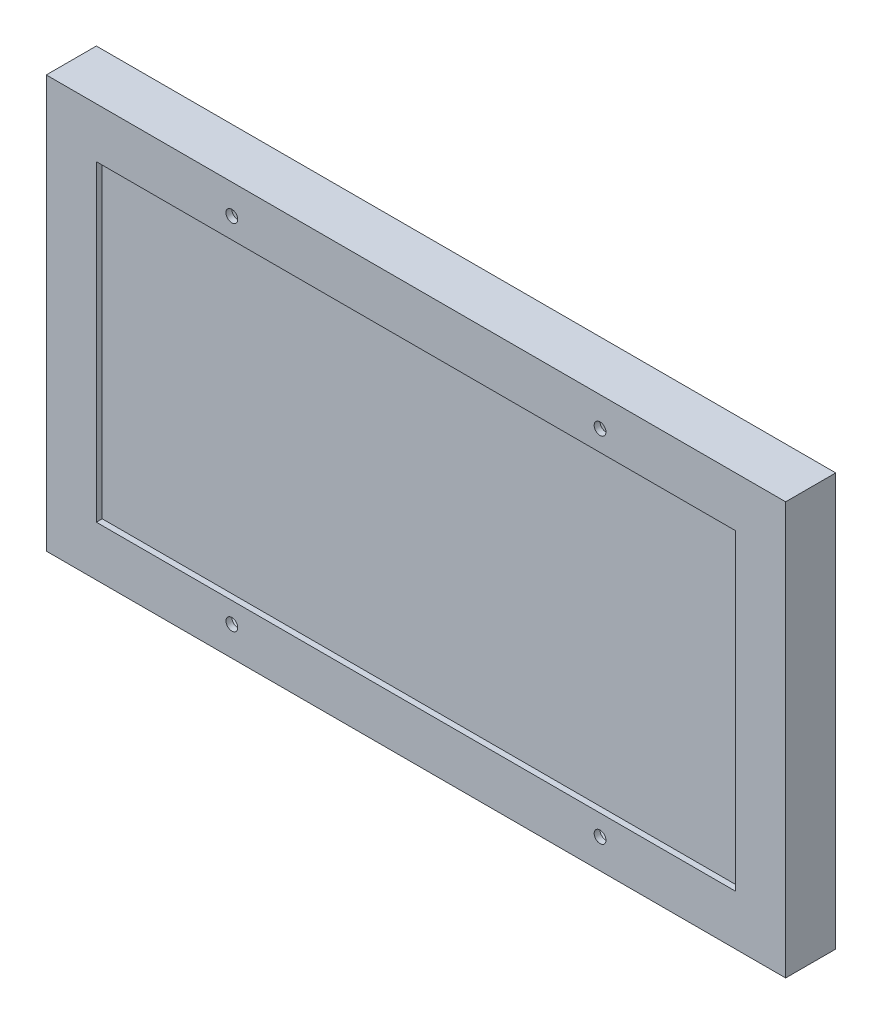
from build123d import *

# Parameters (mm, degrees)
SKETCH1_W           = 251
SKETCH1_H           = 140
BOSS_EXTRUDE1_DEPTH = 17
SKETCH2_W           = 217
SKETCH2_H           = 106
CUT_EXTRUDE1_DEPTH  = 12.45
CUT_EXTRUDE2_START  = -15
SKETCH3_W           = 10.45
SKETCH3_H           = 128.818099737
CUT_EXTRUDE2_DEPTH  = 140.5
CUT_EXTRUDE3_REACH  = 146.704
SKETCH4_R           = 2
SKETCH6_W           = 0.314102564
SKETCH6_H           = 3.58974359
CUT_EXTRUDE4_DEPTH  = 0.01


with BuildPart() as part:
    # Sketch1 → Boss-Extrude1 (new body)
    with BuildSketch(Plane.XY):
        Rectangle(SKETCH1_W, SKETCH1_H)
    extrude(amount=BOSS_EXTRUDE1_DEPTH)

    # Sketch2 → Cut-Extrude1 (cut)
    with BuildSketch(Plane.XY.offset(17)):
        Rectangle(SKETCH2_W, SKETCH2_H)
    extrude(amount=-CUT_EXTRUDE1_DEPTH, mode=Mode.SUBTRACT)

    # Sketch3 → Cut-Extrude2 (cut)
    with BuildSketch(Plane(origin=(-108.5, 0, 0), x_dir=(0, 0, -1), z_dir=(1, 0, 0)).offset(CUT_EXTRUDE2_START)):
        with Locations((-9.775, -0.166595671)):
            Rectangle(SKETCH3_W, SKETCH3_H)
    cut_extrude2 = extrude(amount=CUT_EXTRUDE2_DEPTH, mode=Mode.SUBTRACT)

    # Mirror1: Cut-Extrude2 across plane
    add(cut_extrude2.mirror(Plane(origin=(0, 0, 0), x_dir=(0, 0, 1), z_dir=(1, 0, 0))), mode=Mode.SUBTRACT)

    # Sketch4 → Cut-Extrude3 (cut, up to next)
    with BuildSketch(Plane.XY.offset(17), mode=Mode.PRIVATE) as cut_extrude3_sk1:
        with Locations((-62.5, 60)):
            Circle(SKETCH4_R)
    cut_extrude3_tool1 = extrude(cut_extrude3_sk1.sketch, amount=-CUT_EXTRUDE3_REACH, mode=Mode.PRIVATE) & part.part
    # Sketch4 → Cut-Extrude3 (cut, up to next)
    with BuildSketch(Plane.XY.offset(17), mode=Mode.PRIVATE) as cut_extrude3_sk2:
        with Locations((62.5, 60)):
            Circle(SKETCH4_R)
    cut_extrude3_tool2 = extrude(cut_extrude3_sk2.sketch, amount=-CUT_EXTRUDE3_REACH, mode=Mode.PRIVATE) & part.part
    # Sketch4 → Cut-Extrude3 (cut, up to next)
    with BuildSketch(Plane.XY.offset(17), mode=Mode.PRIVATE) as cut_extrude3_sk3:
        with Locations((-62.5, -60)):
            Circle(SKETCH4_R)
    cut_extrude3_tool3 = extrude(cut_extrude3_sk3.sketch, amount=-CUT_EXTRUDE3_REACH, mode=Mode.PRIVATE) & part.part
    # Sketch4 → Cut-Extrude3 (cut, up to next)
    with BuildSketch(Plane.XY.offset(17), mode=Mode.PRIVATE) as cut_extrude3_sk4:
        with Locations((62.5, -60)):
            Circle(SKETCH4_R)
    cut_extrude3_tool4 = extrude(cut_extrude3_sk4.sketch, amount=-CUT_EXTRUDE3_REACH, mode=Mode.PRIVATE) & part.part
    add(cut_extrude3_tool1.solids().sort_by_distance((-62.5, 60, 17))[0], mode=Mode.SUBTRACT)
    add(cut_extrude3_tool2.solids().sort_by_distance((62.5, 60, 17))[0], mode=Mode.SUBTRACT)
    add(cut_extrude3_tool3.solids().sort_by_distance((-62.5, -60, 17))[0], mode=Mode.SUBTRACT)
    add(cut_extrude3_tool4.solids().sort_by_distance((62.5, -60, 17))[0], mode=Mode.SUBTRACT)

    # Sketch6 → Cut-Extrude4 (cut)
    # profile 1 of 19: a face of its own
    with BuildSketch(Plane(origin=(0, 0, 0), x_dir=(-1, 0, 0), z_dir=(0, 0, -1))):
        with BuildLine():
            Line((-19.937291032, 10.102725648), (-19.641417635, 10.280109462))
            add(Edge.make_bspline(
                [(-19.641417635, 10.280109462), (-19.613899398, 10.234045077), (-19.561175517, 10.145787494), (-19.473224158, 10.026529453), (-19.382091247, 9.925167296), (-19.287101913, 9.842290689), (-19.188835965, 9.777041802), (-19.086651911, 9.73083957), (-18.9808941, 9.702023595), (-18.908920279, 9.698523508), (-18.872988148, 9.696776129)],
                knots=[0, 0, 0, 0, 1.272034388, 2.437168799, 3.508375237, 4.49857839, 5.41946034, 6.295179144, 7.148887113, 8, 8, 8, 8], degree=3))
            add(Edge.make_bspline(
                [(-18.872988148, 9.696776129), (-18.842301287, 9.697630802), (-18.781464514, 9.699325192), (-18.691902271, 9.715605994), (-18.604920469, 9.740618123), (-18.522311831, 9.776439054), (-18.445216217, 9.81977754), (-18.377609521, 9.872123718), (-18.319163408, 9.930729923), (-18.271354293, 9.996112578), (-18.234674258, 10.066429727), (-18.20648219, 10.138605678), (-18.190837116, 10.213774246), (-18.188480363, 10.264384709), (-18.187291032, 10.289925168)],
                knots=[0, 0, 0, 0, 1.095163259, 2.171163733, 3.241058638, 4.321873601, 5.38011039, 6.391990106, 7.366004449, 8.327778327, 9.272591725, 10.192022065, 11.087607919, 12, 12, 12, 12], degree=3))
            add(Edge.make_bspline(
                [(-18.187291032, 10.289925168), (-18.188765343, 10.319066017), (-18.191762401, 10.378305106), (-18.217093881, 10.465704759), (-18.256943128, 10.552197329), (-18.293705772, 10.605698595), (-18.312791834, 10.633474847)],
                knots=[0, 0, 0, 0, 0.938893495, 1.908633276, 2.914225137, 4, 4, 4, 4], degree=3))
            add(Edge.make_bspline(
                [(-18.312791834, 10.633474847), (-18.328462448, 10.653521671), (-18.361360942, 10.695607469), (-18.417918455, 10.758252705), (-18.484284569, 10.822871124), (-18.558188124, 10.891930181), (-18.642321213, 10.962217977), (-18.734048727, 11.037086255), (-18.835712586, 11.113687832), (-18.907012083, 11.165060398), (-18.943801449, 11.191567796)],
                knots=[0, 0, 0, 0, 0.722233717, 1.516239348, 2.393582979, 3.351407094, 4.387010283, 5.505090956, 6.712668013, 8, 8, 8, 8], degree=3))
            add(Edge.make_bspline(
                [(-18.943801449, 11.191567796), (-18.980625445, 11.217796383), (-19.051030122, 11.267943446), (-19.149488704, 11.34236773), (-19.237533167, 11.410411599), (-19.314772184, 11.472715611), (-19.38117178, 11.529288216), (-19.437255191, 11.579586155), (-19.481593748, 11.624969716), (-19.506249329, 11.654411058), (-19.517319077, 11.667629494)],
                knots=[0, 0, 0, 0, 1.452282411, 2.77665338, 3.964542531, 5.026858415, 5.96415736, 6.766646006, 7.446254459, 8, 8, 8, 8], degree=3))
            add(Edge.make_bspline(
                [(-19.517319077, 11.667629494), (-19.532791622, 11.688230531), (-19.563220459, 11.728745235), (-19.603386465, 11.792070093), (-19.637525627, 11.856893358), (-19.664287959, 11.923389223), (-19.686824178, 11.990624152), (-19.701982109, 12.059475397), (-19.711473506, 12.129634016), (-19.712445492, 12.176847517), (-19.712932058, 12.200482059)],
                knots=[0, 0, 0, 0, 1.068054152, 2.10047183, 3.106115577, 4.101338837, 5.06977816, 6.043150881, 7.020423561, 8, 8, 8, 8], degree=3))
            add(Edge.make_bspline(
                [(-19.712932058, 12.200482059), (-19.711626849, 12.237511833), (-19.709044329, 12.310779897), (-19.687203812, 12.417810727), (-19.652730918, 12.519997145), (-19.60443603, 12.616327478), (-19.542178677, 12.704293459), (-19.470132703, 12.784906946), (-19.384321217, 12.852675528), (-19.290168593, 12.911887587), (-19.187112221, 12.958233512), (-19.079121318, 12.993194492), (-18.966024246, 13.01300375), (-18.889421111, 13.015846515), (-18.85055225, 13.01728895)],
                knots=[0, 0, 0, 0, 1.005424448, 1.989358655, 2.955360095, 3.929531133, 4.905563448, 5.876582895, 6.856512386, 7.866279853, 8.892233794, 9.918561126, 10.94386622, 12, 12, 12, 12], degree=3))
            add(Edge.make_bspline(
                [(-18.85055225, 13.01728895), (-18.80930815, 13.015866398), (-18.727286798, 13.013037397), (-18.606637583, 12.988439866), (-18.490476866, 12.947739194), (-18.397033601, 12.901550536), (-18.32390084, 12.85541912), (-18.268128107, 12.813399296), (-18.211610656, 12.765024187), (-18.153892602, 12.710164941), (-18.095951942, 12.64831819), (-18.03692849, 12.579907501), (-17.976684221, 12.505350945), (-17.937928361, 12.452126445), (-17.918060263, 12.424841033)],
                knots=[0, 0, 0, 0, 1.286793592, 2.559021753, 3.825965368, 5.121522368, 5.803751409, 6.523245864, 7.299691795, 8.125521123, 9.008227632, 9.944561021, 10.946284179, 12, 12, 12, 12], degree=3))
            Line((-17.918060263, 12.424841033), (-18.20201459, 12.209596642))
            add(Edge.make_bspline(
                [(-18.20201459, 12.209596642), (-18.219160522, 12.231685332), (-18.252179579, 12.274222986), (-18.302309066, 12.333794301), (-18.349557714, 12.388210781), (-18.396108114, 12.435475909), (-18.439501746, 12.478178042), (-18.481618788, 12.514737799), (-18.521853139, 12.545513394), (-18.57257005, 12.578356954), (-18.636287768, 12.610913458), (-18.716272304, 12.638462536), (-18.799858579, 12.655017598), (-18.856788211, 12.657206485), (-18.88560834, 12.658314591)],
                knots=[0, 0, 0, 0, 1.181633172, 2.275549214, 3.290209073, 4.226197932, 5.078386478, 5.862611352, 6.581680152, 7.217281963, 8.414376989, 9.595101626, 10.782541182, 12, 12, 12, 12], degree=3))
            add(Edge.make_bspline(
                [(-18.88560834, 12.658314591), (-18.921764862, 12.657102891), (-18.99148931, 12.654766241), (-19.090479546, 12.629246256), (-19.179573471, 12.589064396), (-19.256126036, 12.532749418), (-19.319863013, 12.466028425), (-19.365968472, 12.38924957), (-19.393718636, 12.304467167), (-19.397104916, 12.245325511), (-19.398829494, 12.215205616)],
                knots=[0, 0, 0, 0, 1.14458467, 2.207223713, 3.21896685, 4.227309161, 5.202851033, 6.127160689, 7.046193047, 8, 8, 8, 8], degree=3))
            add(Edge.make_bspline(
                [(-19.398829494, 12.215205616), (-19.398436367, 12.196454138), (-19.397649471, 12.158920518), (-19.386674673, 12.103469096), (-19.372575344, 12.048157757), (-19.350232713, 11.993235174), (-19.319387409, 11.937740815), (-19.278882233, 11.880719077), (-19.227868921, 11.821667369), (-19.188791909, 11.783259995), (-19.168160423, 11.762982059)],
                knots=[0, 0, 0, 0, 0.858281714, 1.717966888, 2.583508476, 3.4729293, 4.427298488, 5.488583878, 6.674047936, 8, 8, 8, 8], degree=3))
            add(Edge.make_bspline(
                [(-19.168160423, 11.762982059), (-19.160499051, 11.756145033), (-19.142297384, 11.739901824), (-19.109021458, 11.713309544), (-19.06507866, 11.680506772), (-19.011616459, 11.639919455), (-18.947649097, 11.592837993), (-18.873169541, 11.539864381), (-18.789008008, 11.479278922), (-18.729286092, 11.436921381), (-18.697707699, 11.414524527)],
                knots=[0, 0, 0, 0, 0.420754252, 0.999615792, 1.744751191, 2.668019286, 3.750313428, 4.999500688, 6.413464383, 8, 8, 8, 8], degree=3))
            add(Edge.make_bspline(
                [(-18.697707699, 11.414524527), (-18.659721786, 11.386883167), (-18.586167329, 11.333359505), (-18.481509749, 11.252943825), (-18.386615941, 11.174296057), (-18.301152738, 11.09791845), (-18.224275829, 11.024390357), (-18.156838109, 10.952827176), (-18.098152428, 10.883741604), (-18.03497321, 10.795169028), (-17.97041539, 10.686387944), (-17.914973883, 10.553109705), (-17.880015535, 10.419313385), (-17.87544402, 10.329386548), (-17.873188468, 10.285017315)],
                knots=[0, 0, 0, 0, 1.163667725, 2.253281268, 3.268753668, 4.215851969, 5.092017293, 5.902905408, 6.650798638, 7.335211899, 8.59617414, 9.77448103, 10.901945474, 12, 12, 12, 12], degree=3))
            add(Edge.make_bspline(
                [(-17.873188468, 10.285017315), (-17.873845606, 10.25363895), (-17.875147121, 10.191491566), (-17.890108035, 10.100236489), (-17.9120277, 10.01160562), (-17.945064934, 9.926694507), (-17.985388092, 9.843949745), (-18.03655434, 9.765541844), (-18.095862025, 9.689735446), (-18.16389579, 9.618551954), (-18.238341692, 9.553205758), (-18.317025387, 9.495076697), (-18.40007566, 9.446608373), (-18.487041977, 9.407057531), (-18.577944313, 9.376124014), (-18.672752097, 9.353711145), (-18.771621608, 9.339955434), (-18.83882209, 9.338527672), (-18.872988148, 9.33780177)],
                knots=[0, 0, 0, 0, 0.983748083, 1.948392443, 2.894712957, 3.844097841, 4.80183111, 5.778335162, 6.776009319, 7.81870978, 8.863265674, 9.881300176, 10.883814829, 11.87499822, 12.874611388, 13.892143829, 14.928324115, 16, 16, 16, 16], degree=3))
            add(Edge.make_bspline(
                [(-18.872988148, 9.33780177), (-18.899423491, 9.338312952), (-18.951961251, 9.339328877), (-19.029670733, 9.348310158), (-19.105810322, 9.361017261), (-19.179424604, 9.381191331), (-19.251462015, 9.405668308), (-19.32160925, 9.435806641), (-19.389900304, 9.471923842), (-19.456717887, 9.513218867), (-19.521892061, 9.561276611), (-19.584811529, 9.617250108), (-19.647540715, 9.679595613), (-19.708228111, 9.750006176), (-19.768101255, 9.827344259), (-19.825979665, 9.912333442), (-19.883061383, 10.004510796), (-19.91887685, 10.069375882), (-19.937291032, 10.102725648)],
                knots=[0, 0, 0, 0, 0.915332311, 1.819136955, 2.706846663, 3.586547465, 4.459518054, 5.340707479, 6.227863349, 7.133153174, 8.059268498, 9.028702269, 10.047606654, 11.120612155, 12.245963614, 13.433783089, 14.680604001, 16, 16, 16, 16], degree=3))
        make_face()
    # profile 2 of 19: a face of its own
    with BuildSketch(Plane(origin=(0, 0, 0), x_dir=(-1, 0, 0), z_dir=(0, 0, -1))):
        with BuildLine():
            add(Edge.make_bspline(
                [(-16.009606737, 12.030109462), (-15.961615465, 12.029087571), (-15.867516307, 12.027083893), (-15.729708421, 12.005668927), (-15.598163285, 11.972921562), (-15.472377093, 11.92765), (-15.353960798, 11.86696805), (-15.241189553, 11.794558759), (-15.134372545, 11.708776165), (-15.070349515, 11.642418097), (-15.03785193, 11.608735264)],
                knots=[0, 0, 0, 0, 1.054011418, 2.066658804, 3.057071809, 4.030435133, 4.997543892, 5.974964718, 6.972108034, 8, 8, 8, 8], degree=3))
            add(Edge.make_bspline(
                [(-15.03785193, 11.608735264), (-15.009869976, 11.576521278), (-14.954447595, 11.512716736), (-14.883381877, 11.409261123), (-14.822160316, 11.302121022), (-14.773097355, 11.189873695), (-14.734412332, 11.073499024), (-14.706946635, 10.952597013), (-14.690609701, 10.827434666), (-14.688406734, 10.742430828), (-14.687291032, 10.699380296)],
                knots=[0, 0, 0, 0, 1.025258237, 2.030674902, 3.01204498, 3.988269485, 4.97094183, 5.956517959, 6.965070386, 8, 8, 8, 8], degree=3))
            add(Edge.make_bspline(
                [(-14.687291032, 10.699380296), (-14.68827237, 10.656080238), (-14.690211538, 10.570517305), (-14.708555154, 10.444497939), (-14.73708624, 10.322303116), (-14.777918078, 10.204444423), (-14.830276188, 10.090561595), (-14.894166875, 9.981152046), (-14.970038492, 9.875999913), (-15.056042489, 9.775998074), (-15.151094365, 9.68383186), (-15.254210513, 9.60350359), (-15.363364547, 9.534682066), (-15.480007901, 9.47924565), (-15.603075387, 9.43553595), (-15.732832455, 9.404835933), (-15.869077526, 9.386274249), (-15.962104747, 9.383890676), (-16.009606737, 9.382673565)],
                knots=[0, 0, 0, 0, 0.998656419, 1.973391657, 2.932242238, 3.890759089, 4.846373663, 5.82037756, 6.809684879, 7.83454468, 8.860553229, 9.859544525, 10.845671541, 11.83227036, 12.833544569, 13.85385346, 14.904124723, 16, 16, 16, 16], degree=3))
            add(Edge.make_bspline(
                [(-16.009606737, 9.382673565), (-16.057341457, 9.383894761), (-16.150832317, 9.386286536), (-16.287558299, 9.404763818), (-16.417547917, 9.435521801), (-16.540776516, 9.479389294), (-16.657921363, 9.534683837), (-16.76770786, 9.603295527), (-16.870907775, 9.683855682), (-16.96597976, 9.775991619), (-17.051978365, 9.876001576), (-17.127851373, 9.981151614), (-17.1917417, 10.090561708), (-17.244099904, 10.204444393), (-17.284931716, 10.322303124), (-17.313462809, 10.444497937), (-17.331806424, 10.570517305), (-17.333745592, 10.656080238), (-17.33472693, 10.699380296)],
                knots=[0, 0, 0, 0, 1.099876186, 2.154163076, 3.173186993, 4.173200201, 5.163417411, 6.152872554, 7.150605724, 8.17532212, 9.198891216, 10.186952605, 11.159729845, 12.11414092, 13.071450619, 14.029093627, 15.002601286, 16, 16, 16, 16], degree=3))
            add(Edge.make_bspline(
                [(-17.33472693, 10.699380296), (-17.333603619, 10.742196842), (-17.331379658, 10.826966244), (-17.315059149, 10.951893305), (-17.287700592, 11.072590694), (-17.248969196, 11.18851617), (-17.199454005, 11.300271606), (-17.139092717, 11.407676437), (-17.067302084, 11.510664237), (-17.012100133, 11.574386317), (-16.984166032, 11.606631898)],
                knots=[0, 0, 0, 0, 1.031353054, 2.041901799, 3.029428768, 4.008703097, 4.981709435, 5.96992636, 6.972712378, 8, 8, 8, 8], degree=3))
            add(Edge.make_bspline(
                [(-16.984166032, 11.606631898), (-16.951717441, 11.640606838), (-16.887901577, 11.707424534), (-16.78055285, 11.792957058), (-16.668059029, 11.866873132), (-16.548334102, 11.926349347), (-16.422651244, 11.973187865), (-16.290432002, 12.00575338), (-16.152156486, 12.027006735), (-16.057596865, 12.029064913), (-16.009606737, 12.030109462)],
                knots=[0, 0, 0, 0, 1.027980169, 2.021703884, 2.998553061, 3.971491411, 4.943284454, 5.930300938, 6.949603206, 8, 8, 8, 8], degree=3))
        make_face()
        with BuildLine():
            add(Edge.make_bspline(
                [(-16.011008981, 11.716006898), (-16.044946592, 11.715042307), (-16.111945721, 11.713138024), (-16.210565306, 11.698654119), (-16.30550546, 11.675706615), (-16.396946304, 11.643102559), (-16.484579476, 11.60100366), (-16.568488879, 11.5492953), (-16.648921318, 11.488662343), (-16.724303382, 11.419199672), (-16.793485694, 11.343320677), (-16.853963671, 11.262472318), (-16.905388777, 11.177965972), (-16.948228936, 11.089713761), (-16.980136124, 10.996821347), (-17.003309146, 10.900340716), (-17.017779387, 10.800075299), (-17.019665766, 10.731914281), (-17.020624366, 10.69727693)],
                knots=[0, 0, 0, 0, 1.021534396, 2.016698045, 2.994645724, 3.958388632, 4.93408049, 5.916473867, 6.921342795, 7.962252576, 8.998418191, 10.008913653, 10.997312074, 11.973003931, 12.956656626, 13.948281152, 14.957379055, 16, 16, 16, 16], degree=3))
            add(Edge.make_bspline(
                [(-17.020624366, 10.69727693), (-17.019017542, 10.652524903), (-17.015828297, 10.563700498), (-16.989893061, 10.432889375), (-16.946506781, 10.307307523), (-16.887919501, 10.187691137), (-16.814513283, 10.077018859), (-16.728026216, 9.978347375), (-16.629386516, 9.893161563), (-16.519770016, 9.822480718), (-16.401415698, 9.766320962), (-16.276159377, 9.726521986), (-16.145518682, 9.700650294), (-16.056237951, 9.698078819), (-16.011008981, 9.696776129)],
                knots=[0, 0, 0, 0, 1.016792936, 2.018143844, 3.017858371, 4.030088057, 5.03801393, 6.028138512, 7.003788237, 7.991172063, 8.984598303, 9.972568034, 10.972917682, 12, 12, 12, 12], degree=3))
            add(Edge.make_bspline(
                [(-16.011008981, 9.696776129), (-15.965782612, 9.698086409), (-15.876507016, 9.700672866), (-15.746047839, 9.726391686), (-15.621133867, 9.766495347), (-15.50290248, 9.822417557), (-15.393335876, 9.893429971), (-15.293986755, 9.977866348), (-15.208238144, 10.0772802), (-15.134904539, 10.187837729), (-15.075357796, 10.307122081), (-15.032174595, 10.432912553), (-15.006177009, 10.563694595), (-15.00299618, 10.652522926), (-15.001393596, 10.69727693)],
                knots=[0, 0, 0, 0, 1.02726834, 2.027799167, 3.010890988, 4.004497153, 4.992059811, 5.971914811, 6.958719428, 7.966827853, 8.981595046, 9.981490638, 10.983022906, 12, 12, 12, 12], degree=3))
            add(Edge.make_bspline(
                [(-15.001393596, 10.69727693), (-15.002351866, 10.731914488), (-15.004237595, 10.800075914), (-15.01871256, 10.900338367), (-15.0418681, 10.996829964), (-15.073839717, 11.089681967), (-15.116493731, 11.178194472), (-15.168910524, 11.262224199), (-15.229141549, 11.343600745), (-15.29915867, 11.418954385), (-15.374462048, 11.488689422), (-15.454927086, 11.549318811), (-15.538712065, 11.600776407), (-15.626090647, 11.643462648), (-15.717543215, 11.675409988), (-15.812350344, 11.698786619), (-15.910549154, 11.713076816), (-15.977308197, 11.715023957), (-16.011008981, 11.716006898)],
                knots=[0, 0, 0, 0, 1.042956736, 2.052379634, 3.044323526, 4.02829302, 5.004299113, 5.996692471, 7.007513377, 8.048758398, 9.090003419, 10.095195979, 11.07790575, 12.047570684, 13.018257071, 13.989683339, 14.985167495, 16, 16, 16, 16], degree=3))
        make_face(mode=Mode.SUBTRACT)
    # profile 3 of 19: a face of its own
    with BuildSketch(Plane(origin=(0, 0, 0), x_dir=(-1, 0, 0), z_dir=(0, 0, -1))):
        with Locations((-13.946906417, 11.222417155)):
            Rectangle(SKETCH6_W, SKETCH6_H)
    # profile 4 of 19: a face of its own
    with BuildSketch(Plane(origin=(0, 0, 0), x_dir=(-1, 0, 0), z_dir=(0, 0, -1))):
        with BuildLine():
            Line((-10.469342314, 11.985237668), (-10.469342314, 9.42754536))
            Line((-10.469342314, 9.42754536), (-10.783444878, 9.42754536))
            Line((-10.783444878, 9.42754536), (-10.783444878, 9.869953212))
            add(Edge.make_bspline(
                [(-10.783444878, 9.869953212), (-10.818863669, 9.829913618), (-10.887983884, 9.751775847), (-11.003425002, 9.649693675), (-11.12579318, 9.565315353), (-11.254494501, 9.497165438), (-11.389412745, 9.445973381), (-11.530248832, 9.409587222), (-11.677060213, 9.386193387), (-11.777312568, 9.383857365), (-11.828116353, 9.382673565)],
                knots=[0, 0, 0, 0, 1.074387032, 2.096679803, 3.090159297, 4.057316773, 5.018401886, 5.985159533, 6.978961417, 8, 8, 8, 8], degree=3))
            add(Edge.make_bspline(
                [(-11.828116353, 9.382673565), (-11.873284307, 9.383899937), (-11.962357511, 9.386318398), (-12.093386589, 9.405080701), (-12.219478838, 9.435211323), (-12.340753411, 9.477112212), (-12.456425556, 9.532693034), (-12.567485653, 9.599234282), (-12.673358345, 9.678475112), (-12.772429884, 9.769063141), (-12.863661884, 9.867458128), (-12.943723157, 9.972403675), (-13.010476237, 10.083445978), (-13.066296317, 10.199179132), (-13.109292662, 10.320494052), (-13.139266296, 10.44697122), (-13.158006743, 10.578461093), (-13.160424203, 10.668000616), (-13.161650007, 10.713402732)],
                knots=[0, 0, 0, 0, 1.033919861, 2.038935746, 3.024066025, 3.998881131, 4.97069526, 5.957263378, 6.95902576, 7.993208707, 9.027059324, 10.027763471, 11.009749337, 11.988697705, 12.965288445, 13.950418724, 14.960734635, 16, 16, 16, 16], degree=3))
            add(Edge.make_bspline(
                [(-13.161650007, 10.713402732), (-13.160397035, 10.757866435), (-13.157919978, 10.845768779), (-13.139466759, 10.975047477), (-13.10843575, 11.099565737), (-13.064887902, 11.21892268), (-13.009045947, 11.333262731), (-12.94111786, 11.442666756), (-12.861098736, 11.547436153), (-12.768846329, 11.64510738), (-12.668911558, 11.735327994), (-12.562002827, 11.81373704), (-12.450779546, 11.881453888), (-12.333516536, 11.935107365), (-12.211949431, 11.978516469), (-12.084995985, 12.008549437), (-11.953184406, 12.026246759), (-11.863693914, 12.028809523), (-11.818300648, 12.030109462)],
                knots=[0, 0, 0, 0, 1.020392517, 2.01726096, 2.990465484, 3.961182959, 4.928053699, 5.906110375, 6.912531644, 7.948652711, 8.985773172, 9.998621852, 10.987621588, 11.969261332, 12.953316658, 13.946091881, 14.958173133, 16, 16, 16, 16], degree=3))
            add(Edge.make_bspline(
                [(-11.818300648, 12.030109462), (-11.766100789, 12.028671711), (-11.663739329, 12.025852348), (-11.514011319, 12.002389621), (-11.372366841, 11.962751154), (-11.237712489, 11.908833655), (-11.110531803, 11.837184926), (-10.992028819, 11.746804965), (-10.880963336, 11.638263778), (-10.816583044, 11.554893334), (-10.783444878, 11.511980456)],
                knots=[0, 0, 0, 0, 1.038897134, 2.037228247, 3.008116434, 3.962042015, 4.918381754, 5.904844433, 6.921570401, 8, 8, 8, 8], degree=3))
            Line((-10.783444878, 11.511980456), (-10.783444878, 11.985237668))
            Line((-10.783444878, 11.985237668), (-10.469342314, 11.985237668))
        make_face()
        with BuildLine():
            add(Edge.make_bspline(
                [(-11.814093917, 11.716006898), (-11.860008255, 11.714373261), (-11.950635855, 11.71114872), (-12.083679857, 11.685975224), (-12.210993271, 11.64409063), (-12.331939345, 11.586808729), (-12.444607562, 11.514779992), (-12.545301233, 11.427658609), (-12.634843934, 11.327821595), (-12.710152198, 11.215719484), (-12.771542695, 11.095541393), (-12.814709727, 10.969916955), (-12.843178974, 10.841111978), (-12.846087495, 10.753749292), (-12.847547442, 10.709897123)],
                knots=[0, 0, 0, 0, 1.031046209, 2.035121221, 3.029706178, 4.034933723, 5.034054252, 6.02443088, 7.017295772, 8.038157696, 9.050218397, 10.03989886, 11.016116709, 12, 12, 12, 12], degree=3))
            add(Edge.make_bspline(
                [(-12.847547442, 10.709897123), (-12.845682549, 10.666307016), (-12.841960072, 10.57929766), (-12.815209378, 10.450317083), (-12.770329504, 10.324663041), (-12.709087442, 10.203402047), (-12.632400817, 10.090817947), (-12.543512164, 9.989077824), (-12.441561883, 9.901588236), (-12.328634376, 9.828350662), (-12.208026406, 9.769188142), (-12.081192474, 9.728022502), (-11.950516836, 9.701444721), (-11.861664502, 9.698340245), (-11.816898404, 9.696776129)],
                knots=[0, 0, 0, 0, 0.979072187, 1.954306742, 2.945804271, 3.96968567, 4.997920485, 5.998718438, 6.996577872, 8.005894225, 9.015743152, 10.005417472, 10.995077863, 12, 12, 12, 12], degree=3))
            add(Edge.make_bspline(
                [(-11.816898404, 9.696776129), (-11.771451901, 9.698436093), (-11.681063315, 9.701737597), (-11.547624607, 9.727018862), (-11.418129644, 9.76878766), (-11.294342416, 9.826686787), (-11.179026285, 9.898444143), (-11.075528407, 9.982451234), (-10.988012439, 10.080154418), (-10.913819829, 10.187530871), (-10.855644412, 10.305242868), (-10.813268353, 10.430577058), (-10.788214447, 10.563537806), (-10.785056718, 10.654401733), (-10.783444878, 10.700782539)],
                knots=[0, 0, 0, 0, 1.01762866, 2.023962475, 3.030623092, 4.058876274, 5.077231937, 6.066672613, 7.034107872, 8.005628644, 8.981990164, 9.965428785, 10.961468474, 12, 12, 12, 12], degree=3))
            add(Edge.make_bspline(
                [(-10.783444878, 10.700782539), (-10.784404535, 10.73612037), (-10.786293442, 10.805676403), (-10.800724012, 10.907803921), (-10.823678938, 11.005537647), (-10.856025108, 11.098980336), (-10.898516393, 11.187615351), (-10.949764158, 11.272079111), (-11.010669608, 11.351932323), (-11.080252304, 11.426075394), (-11.156417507, 11.493701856), (-11.237012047, 11.554066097), (-11.322990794, 11.60365487), (-11.412907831, 11.644696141), (-11.506919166, 11.677355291), (-11.605789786, 11.699142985), (-11.708468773, 11.714103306), (-11.778514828, 11.715365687), (-11.814093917, 11.716006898)],
                knots=[0, 0, 0, 0, 1.050140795, 2.067009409, 3.05949893, 4.030605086, 5.00011959, 5.97591094, 6.962425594, 7.979863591, 8.993523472, 9.986985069, 10.967611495, 11.937549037, 12.921786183, 13.919465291, 14.943216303, 16, 16, 16, 16], degree=3))
        make_face(mode=Mode.SUBTRACT)
    # profile 5 of 19: a face of its own
    with BuildSketch(Plane(origin=(0, 0, 0), x_dir=(-1, 0, 0), z_dir=(0, 0, -1))):
        with BuildLine():
            Line((-9.841137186, 11.985237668), (-9.527034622, 11.985237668))
            Line((-9.527034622, 11.985237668), (-9.527034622, 11.608735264))
            add(Edge.make_bspline(
                [(-9.527034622, 11.608735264), (-9.503845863, 11.643791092), (-9.459497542, 11.710835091), (-9.385784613, 11.799504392), (-9.310281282, 11.872919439), (-9.232626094, 11.931422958), (-9.152247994, 11.975236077), (-9.070911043, 12.007329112), (-8.987335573, 12.026306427), (-8.931173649, 12.028840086), (-8.903036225, 12.030109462)],
                knots=[0, 0, 0, 0, 1.2804753, 2.448899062, 3.506932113, 4.484331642, 5.4025378, 6.288909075, 7.142734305, 8, 8, 8, 8], degree=3))
            add(Edge.make_bspline(
                [(-8.903036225, 12.030109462), (-8.881209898, 12.028918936), (-8.836300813, 12.02646935), (-8.768318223, 12.009258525), (-8.698274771, 11.981780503), (-8.653132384, 11.95594028), (-8.629598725, 11.942469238)],
                knots=[0, 0, 0, 0, 0.901110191, 1.854092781, 2.881294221, 4, 4, 4, 4], degree=3))
            Line((-8.629598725, 11.942469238), (-8.802074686, 11.670433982))
            add(Edge.make_bspline(
                [(-8.802074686, 11.670433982), (-8.817183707, 11.677174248), (-8.845863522, 11.689968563), (-8.887818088, 11.705110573), (-8.926499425, 11.714026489), (-8.951142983, 11.715377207), (-8.962631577, 11.716006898)],
                knots=[0, 0, 0, 0, 1.180555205, 2.24091978, 3.179933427, 4, 4, 4, 4], degree=3))
            add(Edge.make_bspline(
                [(-8.962631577, 11.716006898), (-8.987837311, 11.714326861), (-9.039249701, 11.710900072), (-9.1147342, 11.683961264), (-9.187981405, 11.640436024), (-9.246153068, 11.592164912), (-9.291195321, 11.545617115), (-9.323335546, 11.504968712), (-9.352818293, 11.45939008), (-9.380988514, 11.409660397), (-9.406654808, 11.354930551), (-9.430609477, 11.295747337), (-9.45226834, 11.232042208), (-9.464618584, 11.187659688), (-9.470944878, 11.164925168)],
                knots=[0, 0, 0, 0, 1.125678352, 2.296057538, 3.5422874, 4.923748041, 5.663163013, 6.437101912, 7.23742474, 8.08941207, 8.991984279, 9.93940061, 10.944477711, 12, 12, 12, 12], degree=3))
            add(Edge.make_bspline(
                [(-9.470944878, 11.164925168), (-9.475677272, 11.144647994), (-9.486159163, 11.099735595), (-9.496350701, 11.024387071), (-9.506420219, 10.935363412), (-9.513516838, 10.832416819), (-9.52009488, 10.715804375), (-9.523804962, 10.585348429), (-9.526908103, 10.440915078), (-9.526991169, 10.339940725), (-9.527034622, 10.28712068)],
                knots=[0, 0, 0, 0, 0.566838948, 1.255505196, 2.06880316, 3.007127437, 4.065329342, 5.249902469, 6.561414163, 8, 8, 8, 8], degree=3))
            Line((-9.527034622, 10.28712068), (-9.527034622, 9.42754536))
            Line((-9.527034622, 9.42754536), (-9.841137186, 9.42754536))
            Line((-9.841137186, 9.42754536), (-9.841137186, 11.985237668))
        make_face()
    # profile 6 of 19: a face of its own
    with BuildSketch(Plane(origin=(0, 0, 0), x_dir=(-1, 0, 0), z_dir=(0, 0, -1))):
        with BuildLine():
            Line((-8.225752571, 12.92754536), (-7.539354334, 12.92754536))
            add(Edge.make_bspline(
                [(-7.539354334, 12.92754536), (-7.492143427, 12.927493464), (-7.401685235, 12.927394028), (-7.271970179, 12.924379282), (-7.154160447, 12.92035259), (-7.048510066, 12.914770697), (-6.954693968, 12.908174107), (-6.873136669, 12.898922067), (-6.803197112, 12.889261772), (-6.761290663, 12.879440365), (-6.742178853, 12.874961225)],
                knots=[0, 0, 0, 0, 1.415646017, 2.712440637, 3.8905458, 4.950247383, 5.884950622, 6.709939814, 7.411656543, 8, 8, 8, 8], degree=3))
            add(Edge.make_bspline(
                [(-6.742178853, 12.874961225), (-6.717985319, 12.868339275), (-6.670168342, 12.855251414), (-6.601267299, 12.82903769), (-6.535713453, 12.797955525), (-6.473281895, 12.762531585), (-6.414739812, 12.721246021), (-6.359213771, 12.675772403), (-6.30719379, 12.625060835), (-6.258972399, 12.569680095), (-6.214687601, 12.510559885), (-6.176557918, 12.446817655), (-6.144630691, 12.379526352), (-6.11724742, 12.308732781), (-6.097538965, 12.233842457), (-6.082692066, 12.155375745), (-6.073268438, 12.073341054), (-6.072365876, 12.017281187), (-6.071906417, 11.988743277)],
                knots=[0, 0, 0, 0, 0.999701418, 1.975846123, 2.934577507, 3.890451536, 4.834027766, 5.787354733, 6.749476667, 7.726910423, 8.712836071, 9.690891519, 10.682875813, 11.679750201, 12.712814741, 13.765529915, 14.8625177, 16, 16, 16, 16], degree=3))
            add(Edge.make_bspline(
                [(-6.071906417, 11.988743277), (-6.072327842, 11.9599655), (-6.073152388, 11.903659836), (-6.083048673, 11.821287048), (-6.096378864, 11.742568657), (-6.116875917, 11.667679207), (-6.14372159, 11.597063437), (-6.175213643, 11.529642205), (-6.213197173, 11.466562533), (-6.256842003, 11.407595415), (-6.305393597, 11.352685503), (-6.358646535, 11.302230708), (-6.416385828, 11.25652637), (-6.478427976, 11.215470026), (-6.545377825, 11.180013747), (-6.616219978, 11.148256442), (-6.691570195, 11.121585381), (-6.743712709, 11.10755532), (-6.770223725, 11.100421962)],
                knots=[0, 0, 0, 0, 1.121902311, 2.195077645, 3.232258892, 4.234102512, 5.217864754, 6.176164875, 7.132989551, 8.084763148, 9.034132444, 9.988522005, 10.94243251, 11.903244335, 12.886203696, 13.894208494, 14.929344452, 16, 16, 16, 16], degree=3))
            add(Edge.make_bspline(
                [(-6.770223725, 11.100421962), (-6.792151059, 11.095758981), (-6.840206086, 11.085539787), (-6.919348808, 11.07413133), (-7.011494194, 11.06439373), (-7.116516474, 11.057092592), (-7.234321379, 11.050842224), (-7.364972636, 11.04587413), (-7.508726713, 11.043144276), (-7.608997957, 11.043003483), (-7.661349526, 11.042929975)],
                knots=[0, 0, 0, 0, 0.601384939, 1.31797006, 2.144135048, 3.087295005, 4.142315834, 5.309527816, 6.595305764, 8, 8, 8, 8], degree=3))
            Line((-7.661349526, 11.042929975), (-7.911650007, 11.042929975))
            Line((-7.911650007, 11.042929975), (-7.911650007, 9.42754536))
            Line((-7.911650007, 9.42754536), (-8.225752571, 9.42754536))
            Line((-8.225752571, 9.42754536), (-8.225752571, 12.92754536))
        make_face()
        with BuildLine():
            Line((-7.911650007, 12.568571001), (-7.911650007, 11.401904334))
            Line((-7.911650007, 11.401904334), (-7.298869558, 11.394191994))
            add(Edge.make_bspline(
                [(-7.298869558, 11.394191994), (-7.268949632, 11.394176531), (-7.211189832, 11.394146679), (-7.127753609, 11.398131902), (-7.050344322, 11.402732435), (-6.979199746, 11.409468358), (-6.914287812, 11.418989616), (-6.855500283, 11.428601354), (-6.803293, 11.442506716), (-6.742193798, 11.461229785), (-6.674110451, 11.493162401), (-6.600042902, 11.539512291), (-6.537272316, 11.598592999), (-6.482954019, 11.665020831), (-6.439848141, 11.73891996), (-6.408292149, 11.817988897), (-6.389750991, 11.901416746), (-6.387264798, 11.958504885), (-6.386008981, 11.987341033)],
                knots=[0, 0, 0, 0, 1.160613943, 2.240541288, 3.23993089, 4.169200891, 5.011653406, 5.7853311, 6.478053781, 7.106038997, 8.262395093, 9.384106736, 10.481365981, 11.59014053, 12.70357646, 13.786202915, 14.881775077, 16, 16, 16, 16], degree=3))
            add(Edge.make_bspline(
                [(-6.386008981, 11.987341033), (-6.387271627, 12.015479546), (-6.389781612, 12.071415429), (-6.408437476, 12.153394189), (-6.439786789, 12.231629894), (-6.483243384, 12.304602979), (-6.535984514, 12.370791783), (-6.597283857, 12.42828891), (-6.666997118, 12.474510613), (-6.731845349, 12.504343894), (-6.789446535, 12.52255917), (-6.839478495, 12.53530401), (-6.89596917, 12.545479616), (-6.958936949, 12.553719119), (-7.027893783, 12.56077258), (-7.103432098, 12.565558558), (-7.185265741, 12.568360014), (-7.242076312, 12.568498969), (-7.271525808, 12.568571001)],
                knots=[0, 0, 0, 0, 1.120700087, 2.227813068, 3.331159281, 4.466773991, 5.599788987, 6.693661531, 7.80175334, 8.91857717, 9.525282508, 10.207424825, 10.974604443, 11.810962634, 12.737642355, 13.736264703, 14.826523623, 16, 16, 16, 16], degree=3))
            Line((-7.271525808, 12.568571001), (-7.911650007, 12.568571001))
        make_face(mode=Mode.SUBTRACT)
    # profile 7 of 19: a face of its own
    with BuildSketch(Plane(origin=(0, 0, 0), x_dir=(-1, 0, 0), z_dir=(0, 0, -1))):
        with BuildLine():
            Line((-2.841137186, 11.985237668), (-2.841137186, 9.42754536))
            Line((-2.841137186, 9.42754536), (-3.15523975, 9.42754536))
            Line((-3.15523975, 9.42754536), (-3.15523975, 9.869953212))
            add(Edge.make_bspline(
                [(-3.15523975, 9.869953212), (-3.190658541, 9.829913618), (-3.259778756, 9.751775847), (-3.375219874, 9.649693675), (-3.497588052, 9.565315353), (-3.626289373, 9.497165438), (-3.761207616, 9.445973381), (-3.902043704, 9.409587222), (-4.048855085, 9.386193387), (-4.149107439, 9.383857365), (-4.199911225, 9.382673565)],
                knots=[0, 0, 0, 0, 1.074387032, 2.096679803, 3.090159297, 4.057316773, 5.018401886, 5.985159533, 6.978961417, 8, 8, 8, 8], degree=3))
            add(Edge.make_bspline(
                [(-4.199911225, 9.382673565), (-4.245079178, 9.383899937), (-4.334152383, 9.386318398), (-4.46518146, 9.405080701), (-4.59127371, 9.435211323), (-4.712548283, 9.477112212), (-4.828220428, 9.532693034), (-4.939280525, 9.599234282), (-5.045153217, 9.678475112), (-5.144224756, 9.769063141), (-5.235456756, 9.867458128), (-5.315518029, 9.972403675), (-5.382271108, 10.083445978), (-5.438091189, 10.199179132), (-5.481087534, 10.320494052), (-5.511061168, 10.44697122), (-5.529801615, 10.578461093), (-5.532219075, 10.668000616), (-5.533444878, 10.713402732)],
                knots=[0, 0, 0, 0, 1.033919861, 2.038935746, 3.024066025, 3.998881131, 4.97069526, 5.957263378, 6.95902576, 7.993208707, 9.027059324, 10.027763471, 11.009749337, 11.988697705, 12.965288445, 13.950418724, 14.960734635, 16, 16, 16, 16], degree=3))
            add(Edge.make_bspline(
                [(-5.533444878, 10.713402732), (-5.532191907, 10.757866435), (-5.52971485, 10.845768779), (-5.51126163, 10.975047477), (-5.480230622, 11.099565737), (-5.436682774, 11.21892268), (-5.380840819, 11.333262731), (-5.312912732, 11.442666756), (-5.232893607, 11.547436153), (-5.1406412, 11.64510738), (-5.04070643, 11.735327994), (-4.933797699, 11.81373704), (-4.822574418, 11.881453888), (-4.705311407, 11.935107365), (-4.583744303, 11.978516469), (-4.456790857, 12.008549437), (-4.324979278, 12.026246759), (-4.235488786, 12.028809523), (-4.190095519, 12.030109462)],
                knots=[0, 0, 0, 0, 1.020392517, 2.01726096, 2.990465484, 3.961182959, 4.928053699, 5.906110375, 6.912531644, 7.948652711, 8.985773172, 9.998621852, 10.987621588, 11.969261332, 12.953316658, 13.946091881, 14.958173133, 16, 16, 16, 16], degree=3))
            add(Edge.make_bspline(
                [(-4.190095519, 12.030109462), (-4.13789566, 12.028671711), (-4.0355342, 12.025852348), (-3.885806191, 12.002389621), (-3.744161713, 11.962751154), (-3.609507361, 11.908833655), (-3.482326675, 11.837184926), (-3.363823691, 11.746804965), (-3.252758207, 11.638263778), (-3.188377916, 11.554893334), (-3.15523975, 11.511980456)],
                knots=[0, 0, 0, 0, 1.038897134, 2.037228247, 3.008116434, 3.962042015, 4.918381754, 5.904844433, 6.921570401, 8, 8, 8, 8], degree=3))
            Line((-3.15523975, 11.511980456), (-3.15523975, 11.985237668))
            Line((-3.15523975, 11.985237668), (-2.841137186, 11.985237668))
        make_face()
        with BuildLine():
            add(Edge.make_bspline(
                [(-4.185888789, 11.716006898), (-4.231803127, 11.714373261), (-4.322430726, 11.71114872), (-4.455474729, 11.685975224), (-4.582788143, 11.64409063), (-4.703734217, 11.586808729), (-4.816402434, 11.514779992), (-4.917096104, 11.427658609), (-5.006638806, 11.327821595), (-5.08194707, 11.215719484), (-5.143337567, 11.095541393), (-5.186504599, 10.969916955), (-5.214973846, 10.841111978), (-5.217882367, 10.753749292), (-5.219342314, 10.709897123)],
                knots=[0, 0, 0, 0, 1.031046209, 2.035121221, 3.029706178, 4.034933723, 5.034054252, 6.02443088, 7.017295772, 8.038157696, 9.050218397, 10.03989886, 11.016116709, 12, 12, 12, 12], degree=3))
            add(Edge.make_bspline(
                [(-5.219342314, 10.709897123), (-5.217477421, 10.666307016), (-5.213754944, 10.57929766), (-5.18700425, 10.450317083), (-5.142124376, 10.324663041), (-5.080882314, 10.203402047), (-5.004195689, 10.090817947), (-4.915307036, 9.989077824), (-4.813356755, 9.901588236), (-4.700429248, 9.828350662), (-4.579821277, 9.769188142), (-4.452987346, 9.728022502), (-4.322311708, 9.701444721), (-4.233459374, 9.698340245), (-4.188693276, 9.696776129)],
                knots=[0, 0, 0, 0, 0.979072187, 1.954306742, 2.945804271, 3.96968567, 4.997920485, 5.998718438, 6.996577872, 8.005894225, 9.015743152, 10.005417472, 10.995077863, 12, 12, 12, 12], degree=3))
            add(Edge.make_bspline(
                [(-4.188693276, 9.696776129), (-4.143246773, 9.698436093), (-4.052858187, 9.701737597), (-3.919419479, 9.727018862), (-3.789924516, 9.76878766), (-3.666137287, 9.826686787), (-3.550821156, 9.898444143), (-3.447323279, 9.982451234), (-3.35980731, 10.080154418), (-3.285614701, 10.187530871), (-3.227439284, 10.305242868), (-3.185063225, 10.430577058), (-3.160009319, 10.563537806), (-3.156851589, 10.654401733), (-3.15523975, 10.700782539)],
                knots=[0, 0, 0, 0, 1.01762866, 2.023962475, 3.030623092, 4.058876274, 5.077231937, 6.066672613, 7.034107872, 8.005628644, 8.981990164, 9.965428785, 10.961468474, 12, 12, 12, 12], degree=3))
            add(Edge.make_bspline(
                [(-3.15523975, 10.700782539), (-3.156199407, 10.73612037), (-3.158088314, 10.805676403), (-3.172518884, 10.907803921), (-3.19547381, 11.005537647), (-3.22781998, 11.098980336), (-3.270311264, 11.187615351), (-3.32155903, 11.272079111), (-3.38246448, 11.351932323), (-3.452047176, 11.426075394), (-3.528212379, 11.493701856), (-3.608806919, 11.554066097), (-3.694785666, 11.60365487), (-3.784702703, 11.644696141), (-3.878714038, 11.677355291), (-3.977584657, 11.699142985), (-4.080263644, 11.714103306), (-4.1503097, 11.715365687), (-4.185888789, 11.716006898)],
                knots=[0, 0, 0, 0, 1.050140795, 2.067009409, 3.05949893, 4.030605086, 5.00011959, 5.97591094, 6.962425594, 7.979863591, 8.993523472, 9.986985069, 10.967611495, 11.937549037, 12.921786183, 13.919465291, 14.943216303, 16, 16, 16, 16], degree=3))
        make_face(mode=Mode.SUBTRACT)
    # profile 8 of 19: a face of its own
    with BuildSketch(Plane(origin=(0, 0, 0), x_dir=(-1, 0, 0), z_dir=(0, 0, -1))):
        with BuildLine():
            Line((-2.123188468, 11.985237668), (-1.809085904, 11.985237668))
            Line((-1.809085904, 11.985237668), (-1.809085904, 11.523899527))
            add(Edge.make_bspline(
                [(-1.809085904, 11.523899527), (-1.775548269, 11.565742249), (-1.710467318, 11.646939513), (-1.602082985, 11.753660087), (-1.487539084, 11.841605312), (-1.367537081, 11.911709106), (-1.241914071, 11.964555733), (-1.111435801, 12.002721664), (-0.975321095, 12.025606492), (-0.882756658, 12.028596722), (-0.835928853, 12.030109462)],
                knots=[0, 0, 0, 0, 1.12780773, 2.188550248, 3.19190651, 4.159438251, 5.104880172, 6.052711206, 7.014878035, 8, 8, 8, 8], degree=3))
            add(Edge.make_bspline(
                [(-0.835928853, 12.030109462), (-0.788598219, 12.028364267), (-0.695960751, 12.024948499), (-0.561082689, 11.997931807), (-0.435109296, 11.951786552), (-0.31848974, 11.888574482), (-0.213362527, 11.809968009), (-0.121037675, 11.718390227), (-0.044674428, 11.613054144), (0.006522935, 11.515330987), (0.040248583, 11.428642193), (0.06148092, 11.354395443), (0.079511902, 11.271677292), (0.09514365, 11.180737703), (0.105720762, 11.080939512), (0.114063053, 10.97269182), (0.120041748, 10.85602969), (0.120278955, 10.775343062), (0.120401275, 10.733735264)],
                knots=[0, 0, 0, 0, 1.235846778, 2.418850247, 3.575807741, 4.728682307, 5.871620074, 6.994088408, 8.11269785, 9.256955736, 9.865816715, 10.540099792, 11.271859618, 12.076849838, 12.949306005, 13.892391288, 14.913166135, 16, 16, 16, 16], degree=3))
            Line((0.120401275, 10.733735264), (0.120401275, 9.42754536))
            Line((0.120401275, 9.42754536), (-0.193701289, 9.42754536))
            Line((-0.193701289, 9.42754536), (-0.193701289, 10.63067036))
            add(Edge.make_bspline(
                [(-0.193701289, 10.63067036), (-0.193894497, 10.665492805), (-0.194264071, 10.732102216), (-0.195429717, 10.827471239), (-0.198239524, 10.913957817), (-0.202187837, 10.991355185), (-0.207966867, 11.059589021), (-0.213989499, 11.118798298), (-0.221354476, 11.16890784), (-0.227917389, 11.199072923), (-0.230860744, 11.21260145)],
                knots=[0, 0, 0, 0, 1.430800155, 2.736877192, 3.918605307, 4.986035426, 5.920637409, 6.731861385, 7.431261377, 8, 8, 8, 8], degree=3))
            add(Edge.make_bspline(
                [(-0.230860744, 11.21260145), (-0.241486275, 11.252312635), (-0.261937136, 11.328744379), (-0.312471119, 11.432418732), (-0.3762853, 11.52061692), (-0.454183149, 11.592793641), (-0.545412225, 11.648964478), (-0.649719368, 11.687938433), (-0.766098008, 11.712314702), (-0.847952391, 11.714741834), (-0.890616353, 11.716006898)],
                knots=[0, 0, 0, 0, 1.084156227, 2.086665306, 3.027808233, 3.945421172, 4.874247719, 5.839848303, 6.874090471, 8, 8, 8, 8], degree=3))
            add(Edge.make_bspline(
                [(-0.890616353, 11.716006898), (-0.915884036, 11.715530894), (-0.965888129, 11.714588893), (-1.040038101, 11.705137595), (-1.111962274, 11.689679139), (-1.182382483, 11.668810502), (-1.249890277, 11.640148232), (-1.316654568, 11.607618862), (-1.380161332, 11.56707065), (-1.44176473, 11.521880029), (-1.499077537, 11.471800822), (-1.552405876, 11.418956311), (-1.599943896, 11.362680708), (-1.643012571, 11.30388076), (-1.680190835, 11.241748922), (-1.712643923, 11.176884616), (-1.740179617, 11.109202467), (-1.75386231, 11.062227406), (-1.7607085, 11.038723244)],
                knots=[0, 0, 0, 0, 1.023777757, 2.026029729, 3.023749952, 4.003683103, 4.997618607, 5.993177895, 7.010360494, 8.046726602, 9.087585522, 10.09234134, 11.086953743, 12.070360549, 13.043493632, 14.017870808, 15.008233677, 16, 16, 16, 16], degree=3))
            add(Edge.make_bspline(
                [(-1.7607085, 11.038723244), (-1.764648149, 11.021468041), (-1.773224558, 10.983904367), (-1.782487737, 10.922259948), (-1.790895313, 10.850949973), (-1.797932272, 10.770057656), (-1.802237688, 10.67929978), (-1.806932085, 10.579063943), (-1.808641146, 10.468950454), (-1.8089335, 10.392288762), (-1.809085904, 10.352325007)],
                knots=[0, 0, 0, 0, 0.615963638, 1.340920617, 2.168419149, 3.115676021, 4.16674242, 5.331190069, 6.6087489, 8, 8, 8, 8], degree=3))
            Line((-1.809085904, 10.352325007), (-1.809085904, 9.42754536))
            Line((-1.809085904, 9.42754536), (-2.123188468, 9.42754536))
            Line((-2.123188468, 9.42754536), (-2.123188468, 11.985237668))
        make_face()
    # profile 9 of 19: a face of its own
    with BuildSketch(Plane(origin=(0, 0, 0), x_dir=(-1, 0, 0), z_dir=(0, 0, -1))):
        with BuildLine():
            Line((2.937508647, 10.235237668), (3.216555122, 10.088703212))
            add(Edge.make_bspline(
                [(3.216555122, 10.088703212), (3.194318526, 10.049259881), (3.151054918, 9.972518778), (3.07665417, 9.867086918), (2.998662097, 9.772239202), (2.913558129, 9.690509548), (2.82388845, 9.619258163), (2.729155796, 9.556920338), (2.628866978, 9.503801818), (2.523017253, 9.45904929), (2.410717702, 9.424639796), (2.291696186, 9.400335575), (2.16572469, 9.385312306), (2.07937851, 9.383567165), (2.035164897, 9.382673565)],
                knots=[0, 0, 0, 0, 1.120438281, 2.179929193, 3.190490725, 4.156257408, 5.095198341, 6.022838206, 6.959905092, 7.901321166, 8.864066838, 9.862729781, 10.905609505, 12, 12, 12, 12], degree=3))
            add(Edge.make_bspline(
                [(2.035164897, 9.382673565), (1.98602292, 9.38382074), (1.890161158, 9.386058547), (1.750621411, 9.405351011), (1.619241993, 9.43682337), (1.496030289, 9.480788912), (1.381288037, 9.538216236), (1.274787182, 9.608175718), (1.175967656, 9.690307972), (1.087943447, 9.785324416), (1.008699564, 9.887006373), (0.938773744, 9.992962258), (0.880316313, 10.102925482), (0.832763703, 10.216196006), (0.794358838, 10.3320599), (0.767592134, 10.451571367), (0.752162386, 10.574406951), (0.749797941, 10.657504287), (0.748606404, 10.699380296)],
                knots=[0, 0, 0, 0, 1.145258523, 2.234067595, 3.276747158, 4.290159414, 5.277019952, 6.260822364, 7.254936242, 8.264827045, 9.274100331, 10.257902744, 11.220704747, 12.172965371, 13.118907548, 14.062713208, 15.023725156, 16, 16, 16, 16], degree=3))
            add(Edge.make_bspline(
                [(0.748606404, 10.699380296), (0.749665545, 10.738675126), (0.751764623, 10.816552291), (0.764995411, 10.931817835), (0.788443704, 11.043846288), (0.820620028, 11.152730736), (0.862171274, 11.25828887), (0.913003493, 11.360584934), (0.973195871, 11.459510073), (1.019668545, 11.521913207), (1.043077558, 11.553346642)],
                knots=[0, 0, 0, 0, 1.024358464, 2.0301432, 3.019427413, 4.004406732, 4.986367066, 5.972626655, 6.978780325, 8, 8, 8, 8], degree=3))
            add(Edge.make_bspline(
                [(1.043077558, 11.553346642), (1.07478524, 11.591215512), (1.137196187, 11.665753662), (1.242752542, 11.763691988), (1.357052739, 11.845735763), (1.478664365, 11.9137429), (1.609000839, 11.965416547), (1.74631013, 12.003924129), (1.892155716, 12.02550214), (1.991860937, 12.028549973), (2.042877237, 12.030109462)],
                knots=[0, 0, 0, 0, 1.030682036, 2.02871468, 2.997146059, 3.962720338, 4.930598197, 5.918074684, 6.934738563, 8, 8, 8, 8], degree=3))
            add(Edge.make_bspline(
                [(2.042877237, 12.030109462), (2.095324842, 12.028755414), (2.198215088, 12.026099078), (2.348247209, 12.001472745), (2.490207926, 11.96242019), (2.62404043, 11.9072664), (2.749758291, 11.836106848), (2.86654434, 11.747965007), (2.976395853, 11.645546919), (3.040304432, 11.56678371), (3.072825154, 11.526704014)],
                knots=[0, 0, 0, 0, 1.056321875, 2.072262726, 3.055038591, 4.01806755, 4.982017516, 5.957941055, 6.960871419, 8, 8, 8, 8], degree=3))
            add(Edge.make_bspline(
                [(3.072825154, 11.526704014), (3.094952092, 11.496500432), (3.139058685, 11.436294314), (3.194305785, 11.338123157), (3.24226318, 11.235412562), (3.280596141, 11.126502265), (3.311635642, 11.012682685), (3.334092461, 10.89314014), (3.34726208, 10.767910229), (3.349850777, 10.682583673), (3.351170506, 10.639083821)],
                knots=[0, 0, 0, 0, 0.94817472, 1.890038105, 2.849395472, 3.817997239, 4.812318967, 5.836947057, 6.897266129, 8, 8, 8, 8], degree=3))
            Line((3.351170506, 10.639083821), (1.062708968, 10.639083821))
            add(Edge.make_bspline(
                [(1.062708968, 10.639083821), (1.064248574, 10.605383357), (1.067276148, 10.539112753), (1.081391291, 10.44214197), (1.103640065, 10.349768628), (1.134909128, 10.262685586), (1.172775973, 10.179755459), (1.21916169, 10.101593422), (1.274501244, 10.028555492), (1.336226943, 9.959988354), (1.404934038, 9.898927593), (1.477216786, 9.844275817), (1.554110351, 9.79847022), (1.635008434, 9.76129033), (1.719780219, 9.732184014), (1.808452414, 9.712316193), (1.900850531, 9.699009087), (1.963836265, 9.697529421), (1.995902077, 9.696776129)],
                knots=[0, 0, 0, 0, 1.094153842, 2.151609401, 3.174256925, 4.172055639, 5.149267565, 6.128595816, 7.11444997, 8.118368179, 9.117203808, 10.09244225, 11.054858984, 12.015122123, 12.976791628, 13.957293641, 14.960065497, 16, 16, 16, 16], degree=3))
            add(Edge.make_bspline(
                [(1.995902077, 9.696776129), (2.027253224, 9.697384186), (2.089459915, 9.698590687), (2.182100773, 9.710322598), (2.2732403, 9.729292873), (2.362501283, 9.755182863), (2.448072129, 9.786759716), (2.527317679, 9.824862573), (2.600197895, 9.86701232), (2.668314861, 9.915221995), (2.734385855, 9.974230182), (2.799928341, 10.047865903), (2.870204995, 10.134953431), (2.914194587, 10.200499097), (2.937508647, 10.235237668)],
                knots=[0, 0, 0, 0, 0.99110716, 1.966546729, 2.947904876, 3.932708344, 4.903319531, 5.828989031, 6.710028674, 7.56322171, 8.463672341, 9.504779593, 10.677557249, 12, 12, 12, 12], degree=3))
        make_face()
        with BuildLine():
            add(Edge.make_bspline(
                [(3.037067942, 10.953186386), (3.025571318, 10.994849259), (3.003444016, 11.07503688), (2.957207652, 11.18607777), (2.905136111, 11.284765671), (2.84351438, 11.370345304), (2.773695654, 11.446348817), (2.693050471, 11.512767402), (2.602614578, 11.572184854), (2.502855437, 11.622337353), (2.397213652, 11.665027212), (2.28660746, 11.693652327), (2.173749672, 11.71326187), (2.097415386, 11.715087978), (2.059003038, 11.716006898)],
                knots=[0, 0, 0, 0, 1.154881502, 2.222775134, 3.210006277, 4.132804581, 5.035138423, 5.962687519, 6.919655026, 7.923214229, 8.944639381, 9.960483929, 10.97369054, 12, 12, 12, 12], degree=3))
            add(Edge.make_bspline(
                [(2.059003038, 11.716006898), (2.0276536, 11.715395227), (1.965682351, 11.714186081), (1.874381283, 11.702715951), (1.786701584, 11.683756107), (1.701996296, 11.65779115), (1.621375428, 11.623182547), (1.543180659, 11.582599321), (1.469400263, 11.533057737), (1.423258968, 11.495298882), (1.399948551, 11.476223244)],
                knots=[0, 0, 0, 0, 1.04873581, 2.073130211, 3.073294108, 4.04793562, 5.032784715, 6.005352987, 6.992311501, 8, 8, 8, 8], degree=3))
            add(Edge.make_bspline(
                [(1.399948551, 11.476223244), (1.383255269, 11.461128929), (1.349472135, 11.430581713), (1.304331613, 11.377952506), (1.261111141, 11.321200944), (1.221777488, 11.258155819), (1.185699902, 11.18953504), (1.151939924, 11.115917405), (1.121553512, 11.036744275), (1.104457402, 10.981571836), (1.095661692, 10.953186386)],
                knots=[0, 0, 0, 0, 0.879870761, 1.780643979, 2.707998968, 3.669668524, 4.684282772, 5.740141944, 6.837334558, 8, 8, 8, 8], degree=3))
            Line((1.095661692, 10.953186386), (3.037067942, 10.953186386))
        make_face(mode=Mode.SUBTRACT)
    # profile 10 of 19: a face of its own
    with BuildSketch(Plane(origin=(0, 0, 0), x_dir=(-1, 0, 0), z_dir=(0, 0, -1))):
        with Locations((4.091555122, 11.222417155)):
            Rectangle(SKETCH6_W, SKETCH6_H)
    # profile 11 of 19: a face of its own
    with BuildSketch(Plane(origin=(0, 0, 0), x_dir=(-1, 0, 0), z_dir=(0, 0, -1))):
        with BuildLine():
            Line((6.043478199, 10.102725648), (6.339351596, 10.280109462))
            add(Edge.make_bspline(
                [(6.339351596, 10.280109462), (6.366869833, 10.234045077), (6.419593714, 10.145787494), (6.507545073, 10.026529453), (6.598677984, 9.925167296), (6.693667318, 9.842290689), (6.791933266, 9.777041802), (6.89411732, 9.73083957), (6.99987513, 9.702023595), (7.071848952, 9.698523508), (7.107781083, 9.696776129)],
                knots=[0, 0, 0, 0, 1.272034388, 2.437168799, 3.508375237, 4.49857839, 5.41946034, 6.295179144, 7.148887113, 8, 8, 8, 8], degree=3))
            add(Edge.make_bspline(
                [(7.107781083, 9.696776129), (7.138467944, 9.697630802), (7.199304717, 9.699325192), (7.28886696, 9.715605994), (7.375848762, 9.740618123), (7.4584574, 9.776439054), (7.535553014, 9.81977754), (7.60315971, 9.872123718), (7.661605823, 9.930729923), (7.709414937, 9.996112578), (7.746094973, 10.066429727), (7.774287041, 10.138605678), (7.789932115, 10.213774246), (7.792288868, 10.264384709), (7.793478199, 10.289925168)],
                knots=[0, 0, 0, 0, 1.095163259, 2.171163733, 3.241058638, 4.321873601, 5.38011039, 6.391990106, 7.366004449, 8.327778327, 9.272591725, 10.192022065, 11.087607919, 12, 12, 12, 12], degree=3))
            add(Edge.make_bspline(
                [(7.793478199, 10.289925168), (7.792003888, 10.319066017), (7.78900683, 10.378305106), (7.76367535, 10.465704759), (7.723826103, 10.552197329), (7.687063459, 10.605698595), (7.667977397, 10.633474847)],
                knots=[0, 0, 0, 0, 0.938893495, 1.908633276, 2.914225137, 4, 4, 4, 4], degree=3))
            add(Edge.make_bspline(
                [(7.667977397, 10.633474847), (7.652306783, 10.653521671), (7.619408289, 10.695607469), (7.562850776, 10.758252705), (7.496484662, 10.822871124), (7.422581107, 10.891930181), (7.338448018, 10.962217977), (7.246720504, 11.037086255), (7.145056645, 11.113687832), (7.073757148, 11.165060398), (7.036967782, 11.191567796)],
                knots=[0, 0, 0, 0, 0.722233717, 1.516239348, 2.393582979, 3.351407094, 4.387010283, 5.505090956, 6.712668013, 8, 8, 8, 8], degree=3))
            add(Edge.make_bspline(
                [(7.036967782, 11.191567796), (7.000143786, 11.217796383), (6.929739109, 11.267943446), (6.831280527, 11.34236773), (6.743236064, 11.410411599), (6.665997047, 11.472715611), (6.59959745, 11.529288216), (6.543514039, 11.579586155), (6.499175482, 11.624969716), (6.474519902, 11.654411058), (6.463450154, 11.667629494)],
                knots=[0, 0, 0, 0, 1.452282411, 2.77665338, 3.964542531, 5.026858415, 5.96415736, 6.766646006, 7.446254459, 8, 8, 8, 8], degree=3))
            add(Edge.make_bspline(
                [(6.463450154, 11.667629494), (6.447977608, 11.688230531), (6.417548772, 11.728745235), (6.377382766, 11.792070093), (6.343243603, 11.856893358), (6.316481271, 11.923389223), (6.293945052, 11.990624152), (6.278787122, 12.059475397), (6.269295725, 12.129634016), (6.268323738, 12.176847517), (6.267837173, 12.200482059)],
                knots=[0, 0, 0, 0, 1.068054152, 2.10047183, 3.106115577, 4.101338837, 5.06977816, 6.043150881, 7.020423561, 8, 8, 8, 8], degree=3))
            add(Edge.make_bspline(
                [(6.267837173, 12.200482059), (6.269142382, 12.237511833), (6.271724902, 12.310779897), (6.293565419, 12.417810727), (6.328038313, 12.519997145), (6.376333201, 12.616327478), (6.438590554, 12.704293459), (6.510636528, 12.784906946), (6.596448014, 12.852675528), (6.690600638, 12.911887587), (6.79365701, 12.958233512), (6.901647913, 12.993194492), (7.014744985, 13.01300375), (7.09134812, 13.015846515), (7.130216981, 13.01728895)],
                knots=[0, 0, 0, 0, 1.005424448, 1.989358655, 2.955360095, 3.929531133, 4.905563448, 5.876582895, 6.856512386, 7.866279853, 8.892233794, 9.918561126, 10.94386622, 12, 12, 12, 12], degree=3))
            add(Edge.make_bspline(
                [(7.130216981, 13.01728895), (7.171461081, 13.015866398), (7.253482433, 13.013037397), (7.374131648, 12.988439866), (7.490292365, 12.947739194), (7.583735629, 12.901550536), (7.656868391, 12.85541912), (7.712641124, 12.813399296), (7.769158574, 12.765024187), (7.826876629, 12.710164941), (7.884817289, 12.64831819), (7.943840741, 12.579907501), (8.00408501, 12.505350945), (8.04284087, 12.452126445), (8.062708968, 12.424841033)],
                knots=[0, 0, 0, 0, 1.286793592, 2.559021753, 3.825965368, 5.121522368, 5.803751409, 6.523245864, 7.299691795, 8.125521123, 9.008227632, 9.944561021, 10.946284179, 12, 12, 12, 12], degree=3))
            Line((8.062708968, 12.424841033), (7.778754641, 12.209596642))
            add(Edge.make_bspline(
                [(7.778754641, 12.209596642), (7.761608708, 12.231685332), (7.728589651, 12.274222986), (7.678460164, 12.333794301), (7.631211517, 12.388210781), (7.584661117, 12.435475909), (7.541267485, 12.478178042), (7.499150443, 12.514737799), (7.458916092, 12.545513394), (7.408199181, 12.578356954), (7.344481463, 12.610913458), (7.264496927, 12.638462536), (7.180910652, 12.655017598), (7.12398102, 12.657206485), (7.095160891, 12.658314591)],
                knots=[0, 0, 0, 0, 1.181633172, 2.275549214, 3.290209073, 4.226197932, 5.078386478, 5.862611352, 6.581680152, 7.217281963, 8.414376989, 9.595101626, 10.782541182, 12, 12, 12, 12], degree=3))
            add(Edge.make_bspline(
                [(7.095160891, 12.658314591), (7.059004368, 12.657102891), (6.989279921, 12.654766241), (6.890289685, 12.629246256), (6.80119576, 12.589064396), (6.724643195, 12.532749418), (6.660906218, 12.466028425), (6.614800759, 12.38924957), (6.587050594, 12.304467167), (6.583664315, 12.245325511), (6.581939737, 12.215205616)],
                knots=[0, 0, 0, 0, 1.14458467, 2.207223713, 3.21896685, 4.227309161, 5.202851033, 6.127160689, 7.046193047, 8, 8, 8, 8], degree=3))
            add(Edge.make_bspline(
                [(6.581939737, 12.215205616), (6.582332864, 12.196454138), (6.58311976, 12.158920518), (6.594094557, 12.103469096), (6.608193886, 12.048157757), (6.630536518, 11.993235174), (6.661381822, 11.937740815), (6.701886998, 11.880719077), (6.75290031, 11.821667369), (6.791977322, 11.783259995), (6.812608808, 11.762982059)],
                knots=[0, 0, 0, 0, 0.858281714, 1.717966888, 2.583508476, 3.4729293, 4.427298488, 5.488583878, 6.674047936, 8, 8, 8, 8], degree=3))
            add(Edge.make_bspline(
                [(6.812608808, 11.762982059), (6.82027018, 11.756145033), (6.838471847, 11.739901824), (6.871747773, 11.713309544), (6.915690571, 11.680506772), (6.969152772, 11.639919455), (7.033120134, 11.592837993), (7.10759969, 11.539864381), (7.191761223, 11.479278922), (7.251483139, 11.436921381), (7.283061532, 11.414524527)],
                knots=[0, 0, 0, 0, 0.420754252, 0.999615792, 1.744751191, 2.668019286, 3.750313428, 4.999500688, 6.413464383, 8, 8, 8, 8], degree=3))
            add(Edge.make_bspline(
                [(7.283061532, 11.414524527), (7.321047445, 11.386883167), (7.394601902, 11.333359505), (7.499259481, 11.252943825), (7.59415329, 11.174296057), (7.679616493, 11.09791845), (7.756493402, 11.024390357), (7.823931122, 10.952827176), (7.882616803, 10.883741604), (7.945796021, 10.795169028), (8.010353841, 10.686387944), (8.065795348, 10.553109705), (8.100753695, 10.419313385), (8.105325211, 10.329386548), (8.107580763, 10.285017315)],
                knots=[0, 0, 0, 0, 1.163667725, 2.253281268, 3.268753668, 4.215851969, 5.092017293, 5.902905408, 6.650798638, 7.335211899, 8.59617414, 9.77448103, 10.901945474, 12, 12, 12, 12], degree=3))
            add(Edge.make_bspline(
                [(8.107580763, 10.285017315), (8.106923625, 10.25363895), (8.105622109, 10.191491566), (8.090661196, 10.100236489), (8.068741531, 10.01160562), (8.035704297, 9.926694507), (7.995381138, 9.843949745), (7.94421489, 9.765541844), (7.884907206, 9.689735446), (7.816873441, 9.618551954), (7.742427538, 9.553205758), (7.663743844, 9.495076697), (7.580693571, 9.446608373), (7.493727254, 9.407057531), (7.402824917, 9.376124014), (7.308017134, 9.353711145), (7.209147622, 9.339955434), (7.141947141, 9.338527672), (7.107781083, 9.33780177)],
                knots=[0, 0, 0, 0, 0.983748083, 1.948392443, 2.894712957, 3.844097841, 4.80183111, 5.778335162, 6.776009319, 7.81870978, 8.863265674, 9.881300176, 10.883814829, 11.87499822, 12.874611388, 13.892143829, 14.928324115, 16, 16, 16, 16], degree=3))
            add(Edge.make_bspline(
                [(7.107781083, 9.33780177), (7.08134574, 9.338312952), (7.02880798, 9.339328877), (6.951098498, 9.348310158), (6.874958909, 9.361017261), (6.801344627, 9.381191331), (6.729307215, 9.405668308), (6.659159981, 9.435806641), (6.590868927, 9.471923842), (6.524051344, 9.513218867), (6.45887717, 9.561276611), (6.395957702, 9.617250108), (6.333228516, 9.679595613), (6.27254112, 9.750006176), (6.212667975, 9.827344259), (6.154789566, 9.912333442), (6.097707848, 10.004510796), (6.06189238, 10.069375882), (6.043478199, 10.102725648)],
                knots=[0, 0, 0, 0, 0.915332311, 1.819136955, 2.706846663, 3.586547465, 4.459518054, 5.340707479, 6.227863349, 7.133153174, 8.059268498, 9.028702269, 10.047606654, 11.120612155, 12.245963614, 13.433783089, 14.680604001, 16, 16, 16, 16], degree=3))
        make_face()
    # profile 12 of 19: a face of its own
    with BuildSketch(Plane(origin=(0, 0, 0), x_dir=(-1, 0, 0), z_dir=(0, 0, -1))):
        with BuildLine():
            Line((8.690914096, 11.985237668), (9.00501666, 11.985237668))
            Line((9.00501666, 11.985237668), (9.00501666, 10.798939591))
            add(Edge.make_bspline(
                [(9.00501666, 10.798939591), (9.005158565, 10.764116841), (9.005430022, 10.697502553), (9.007270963, 10.601647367), (9.011601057, 10.514230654), (9.017014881, 10.435201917), (9.023977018, 10.364574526), (9.032260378, 10.302595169), (9.0415188, 10.248560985), (9.050581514, 10.216017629), (9.054796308, 10.2008827)],
                knots=[0, 0, 0, 0, 1.388932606, 2.656963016, 3.823490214, 4.879454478, 5.816252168, 6.653371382, 7.373723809, 8, 8, 8, 8], degree=3))
            add(Edge.make_bspline(
                [(9.054796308, 10.2008827), (9.061557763, 10.181859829), (9.074940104, 10.144209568), (9.099213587, 10.089820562), (9.129241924, 10.03944528), (9.162101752, 9.991141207), (9.200001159, 9.94633922), (9.24246063, 9.905114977), (9.288058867, 9.865910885), (9.355813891, 9.819526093), (9.448473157, 9.769810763), (9.570125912, 9.726914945), (9.702030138, 9.701279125), (9.793194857, 9.69830487), (9.840052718, 9.696776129)],
                knots=[0, 0, 0, 0, 0.725840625, 1.436591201, 2.137033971, 2.831655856, 3.53531722, 4.242432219, 4.957935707, 5.694543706, 7.190802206, 8.724350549, 10.316345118, 12, 12, 12, 12], degree=3))
            add(Edge.make_bspline(
                [(9.840052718, 9.696776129), (9.886906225, 9.698337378), (9.977559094, 9.701358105), (10.108014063, 9.726141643), (10.227265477, 9.767547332), (10.334116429, 9.825354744), (10.428082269, 9.896096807), (10.506386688, 9.979105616), (10.570993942, 10.071755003), (10.599203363, 10.140879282), (10.613390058, 10.175642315)],
                knots=[0, 0, 0, 0, 1.157059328, 2.238695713, 3.266970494, 4.264342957, 5.228770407, 6.160125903, 7.074715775, 8, 8, 8, 8], degree=3))
            add(Edge.make_bspline(
                [(10.613390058, 10.175642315), (10.617584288, 10.189608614), (10.626856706, 10.220484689), (10.636819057, 10.272864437), (10.645793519, 10.335329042), (10.653456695, 10.408287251), (10.658921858, 10.491548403), (10.661867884, 10.585086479), (10.66519616, 10.688607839), (10.665246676, 10.761075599), (10.66527307, 10.798939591)],
                knots=[0, 0, 0, 0, 0.557542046, 1.232589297, 2.036731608, 2.971723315, 4.038036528, 5.22795436, 6.551621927, 8, 8, 8, 8], degree=3))
            Line((10.66527307, 10.798939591), (10.66527307, 11.985237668))
            Line((10.66527307, 11.985237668), (10.979375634, 11.985237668))
            Line((10.979375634, 11.985237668), (10.979375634, 10.74004536))
            add(Edge.make_bspline(
                [(10.979375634, 10.74004536), (10.97893394, 10.697738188), (10.978076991, 10.615656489), (10.972569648, 10.496372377), (10.963120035, 10.385210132), (10.94877735, 10.282110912), (10.931911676, 10.187153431), (10.910155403, 10.100215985), (10.884177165, 10.021566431), (10.85487165, 9.949824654), (10.820249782, 9.88477776), (10.783422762, 9.823041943), (10.74089799, 9.766149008), (10.696127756, 9.711266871), (10.6463261, 9.661125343), (10.592426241, 9.614573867), (10.535186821, 9.570900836), (10.473337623, 9.531809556), (10.40778156, 9.496592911), (10.338437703, 9.465376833), (10.264456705, 9.440674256), (10.186793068, 9.41936359), (10.105066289, 9.402649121), (10.019355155, 9.390862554), (9.929688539, 9.383637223), (9.86857908, 9.383000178), (9.837248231, 9.382673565)],
                knots=[0, 0, 0, 0, 1.493040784, 2.896703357, 4.213163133, 5.428574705, 6.569057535, 7.615249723, 8.588095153, 9.490268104, 10.346124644, 11.18633936, 12.024365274, 12.850166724, 13.684164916, 14.514361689, 15.362232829, 16.222528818, 17.093394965, 17.986930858, 18.902426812, 19.842810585, 20.827885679, 21.843828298, 22.894529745, 24, 24, 24, 24], degree=3))
            add(Edge.make_bspline(
                [(9.837248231, 9.382673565), (9.806151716, 9.383013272), (9.745044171, 9.383680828), (9.655372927, 9.390822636), (9.569424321, 9.402630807), (9.487503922, 9.419486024), (9.409529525, 9.440525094), (9.335185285, 9.465528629), (9.265341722, 9.496609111), (9.199159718, 9.531586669), (9.13715733, 9.571151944), (9.079048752, 9.614519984), (9.024911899, 9.661626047), (8.974734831, 9.712273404), (8.929221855, 9.76709034), (8.887805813, 9.825635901), (8.849849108, 9.887329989), (8.815496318, 9.953393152), (8.785984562, 10.025965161), (8.759929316, 10.106262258), (8.738618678, 10.195164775), (8.721276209, 10.292596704), (8.707324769, 10.398091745), (8.697638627, 10.512260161), (8.692222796, 10.634823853), (8.691359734, 10.719473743), (8.690914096, 10.763182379)],
                knots=[0, 0, 0, 0, 1.083640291, 2.129454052, 3.13281866, 4.105697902, 5.042300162, 5.946461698, 6.836384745, 7.703652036, 8.553297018, 9.397182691, 10.228592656, 11.052265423, 11.879314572, 12.708807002, 13.549817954, 14.402308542, 15.300838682, 16.27712199, 17.341985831, 18.484375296, 19.725102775, 21.0496083, 22.476576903, 24, 24, 24, 24], degree=3))
            Line((8.690914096, 10.763182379), (8.690914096, 11.985237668))
        make_face()
    # profile 13 of 19: a face of its own
    with BuildSketch(Plane(origin=(0, 0, 0), x_dir=(-1, 0, 0), z_dir=(0, 0, -1))):
        with BuildLine():
            Line((11.607580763, 11.985237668), (11.921683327, 11.985237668))
            Line((11.921683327, 11.985237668), (11.921683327, 11.608735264))
            add(Edge.make_bspline(
                [(11.921683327, 11.608735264), (11.944872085, 11.643791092), (11.989220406, 11.710835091), (12.062933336, 11.799504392), (12.138436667, 11.872919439), (12.216091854, 11.931422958), (12.296469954, 11.975236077), (12.377806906, 12.007329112), (12.461382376, 12.026306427), (12.5175443, 12.028840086), (12.545681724, 12.030109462)],
                knots=[0, 0, 0, 0, 1.2804753, 2.448899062, 3.506932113, 4.484331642, 5.4025378, 6.288909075, 7.142734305, 8, 8, 8, 8], degree=3))
            add(Edge.make_bspline(
                [(12.545681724, 12.030109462), (12.567508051, 12.028918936), (12.612417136, 12.02646935), (12.680399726, 12.009258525), (12.750443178, 11.981780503), (12.795585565, 11.95594028), (12.819119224, 11.942469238)],
                knots=[0, 0, 0, 0, 0.901110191, 1.854092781, 2.881294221, 4, 4, 4, 4], degree=3))
            Line((12.819119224, 11.942469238), (12.646643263, 11.670433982))
            add(Edge.make_bspline(
                [(12.646643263, 11.670433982), (12.631534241, 11.677174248), (12.602854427, 11.689968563), (12.560899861, 11.705110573), (12.522218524, 11.714026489), (12.497574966, 11.715377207), (12.486086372, 11.716006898)],
                knots=[0, 0, 0, 0, 1.180555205, 2.24091978, 3.179933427, 4, 4, 4, 4], degree=3))
            add(Edge.make_bspline(
                [(12.486086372, 11.716006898), (12.460880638, 11.714326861), (12.409468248, 11.710900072), (12.333983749, 11.683961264), (12.260736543, 11.640436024), (12.202564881, 11.592164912), (12.157522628, 11.545617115), (12.125382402, 11.504968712), (12.095899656, 11.45939008), (12.067729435, 11.409660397), (12.042063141, 11.354930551), (12.018108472, 11.295747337), (11.996449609, 11.232042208), (11.984099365, 11.187659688), (11.97777307, 11.164925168)],
                knots=[0, 0, 0, 0, 1.125678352, 2.296057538, 3.5422874, 4.923748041, 5.663163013, 6.437101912, 7.23742474, 8.08941207, 8.991984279, 9.93940061, 10.944477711, 12, 12, 12, 12], degree=3))
            add(Edge.make_bspline(
                [(11.97777307, 11.164925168), (11.973040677, 11.144647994), (11.962558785, 11.099735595), (11.952367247, 11.024387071), (11.942297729, 10.935363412), (11.935201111, 10.832416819), (11.928623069, 10.715804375), (11.924912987, 10.585348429), (11.921809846, 10.440915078), (11.921726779, 10.339940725), (11.921683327, 10.28712068)],
                knots=[0, 0, 0, 0, 0.566838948, 1.255505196, 2.06880316, 3.007127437, 4.065329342, 5.249902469, 6.561414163, 8, 8, 8, 8], degree=3))
            Line((11.921683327, 10.28712068), (11.921683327, 9.42754536))
            Line((11.921683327, 9.42754536), (11.607580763, 9.42754536))
            Line((11.607580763, 9.42754536), (11.607580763, 11.985237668))
        make_face()
    # profile 14 of 19: a face of its own
    with BuildSketch(Plane(origin=(0, 0, 0), x_dir=(-1, 0, 0), z_dir=(0, 0, -1))):
        with BuildLine():
            Line((14.210144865, 12.996255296), (14.210144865, 12.669532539))
            add(Edge.make_bspline(
                [(14.210144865, 12.669532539), (14.180406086, 12.681483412), (14.123961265, 12.704166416), (14.040720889, 12.728831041), (13.964192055, 12.744766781), (13.915038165, 12.747002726), (13.89183557, 12.74805818)],
                knots=[0, 0, 0, 0, 1.16548392, 2.212112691, 3.15604595, 4, 4, 4, 4], degree=3))
            add(Edge.make_bspline(
                [(13.89183557, 12.74805818), (13.876161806, 12.74740684), (13.845822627, 12.746146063), (13.8022193, 12.739717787), (13.762930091, 12.726614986), (13.72802447, 12.70958571), (13.69907401, 12.688231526), (13.674287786, 12.666776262), (13.656321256, 12.642591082), (13.646566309, 12.620070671), (13.640616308, 12.599219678), (13.63882618, 12.577865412), (13.634441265, 12.551641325), (13.633218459, 12.519477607), (13.63043109, 12.482374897), (13.630677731, 12.439548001), (13.628393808, 12.391670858), (13.628735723, 12.357770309), (13.628914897, 12.340005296)],
                knots=[0, 0, 0, 0, 1.311993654, 2.539582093, 3.670788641, 4.763509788, 5.772417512, 6.671800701, 7.496729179, 8.266799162, 8.712543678, 9.304149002, 10.05334463, 10.934920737, 11.99209668, 13.165090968, 14.514413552, 16, 16, 16, 16], degree=3))
            Line((13.628914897, 12.340005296), (13.628914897, 11.985237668))
            Line((13.628914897, 11.985237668), (14.16527307, 11.985237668))
            Line((14.16527307, 11.985237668), (14.16527307, 11.671135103))
            Line((14.16527307, 11.671135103), (13.628213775, 11.671135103))
            Line((13.628213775, 11.671135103), (13.626811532, 9.42754536))
            Line((13.626811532, 9.42754536), (13.312708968, 9.42754536))
            Line((13.312708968, 9.42754536), (13.312708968, 11.671135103))
            Line((13.312708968, 11.671135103), (12.953734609, 11.671135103))
            Line((12.953734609, 11.671135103), (12.953734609, 11.985237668))
            Line((12.953734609, 11.985237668), (13.312708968, 11.985237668))
            Line((13.312708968, 11.985237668), (13.312708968, 12.393991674))
            add(Edge.make_bspline(
                [(13.312708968, 12.393991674), (13.312734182, 12.416667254), (13.312782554, 12.460168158), (13.316170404, 12.522777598), (13.319066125, 12.580601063), (13.324833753, 12.633189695), (13.331495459, 12.681035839), (13.341031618, 12.72342872), (13.350042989, 12.761510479), (13.366391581, 12.804613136), (13.3908138, 12.85346316), (13.430343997, 12.90508706), (13.477737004, 12.951392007), (13.534345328, 12.99039936), (13.598060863, 13.022814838), (13.668942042, 13.046056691), (13.746217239, 13.059197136), (13.799704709, 13.061151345), (13.827332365, 13.062160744)],
                knots=[0, 0, 0, 0, 1.116398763, 2.141702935, 3.087165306, 3.966655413, 4.746276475, 5.464069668, 6.106083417, 6.67047701, 7.730773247, 8.782666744, 9.856985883, 10.980834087, 12.154321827, 13.366232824, 14.639591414, 16, 16, 16, 16], degree=3))
            add(Edge.make_bspline(
                [(13.827332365, 13.062160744), (13.855409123, 13.061203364), (13.914354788, 13.059193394), (14.00655139, 13.046759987), (14.106147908, 13.025288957), (14.174483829, 13.006211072), (14.210144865, 12.996255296)],
                knots=[0, 0, 0, 0, 0.864728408, 1.815451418, 2.859995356, 4, 4, 4, 4], degree=3))
        make_face()
    # profile 15 of 19: a face of its own
    with BuildSketch(Plane(origin=(0, 0, 0), x_dir=(-1, 0, 0), z_dir=(0, 0, -1))):
        with BuildLine():
            Line((17.261426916, 11.985237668), (17.261426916, 9.42754536))
            Line((17.261426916, 9.42754536), (16.947324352, 9.42754536))
            Line((16.947324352, 9.42754536), (16.947324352, 9.869953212))
            add(Edge.make_bspline(
                [(16.947324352, 9.869953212), (16.911905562, 9.829913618), (16.842785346, 9.751775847), (16.727344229, 9.649693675), (16.604976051, 9.565315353), (16.476274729, 9.497165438), (16.341356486, 9.445973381), (16.200520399, 9.409587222), (16.053709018, 9.386193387), (15.953456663, 9.383857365), (15.902652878, 9.382673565)],
                knots=[0, 0, 0, 0, 1.074387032, 2.096679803, 3.090159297, 4.057316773, 5.018401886, 5.985159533, 6.978961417, 8, 8, 8, 8], degree=3))
            add(Edge.make_bspline(
                [(15.902652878, 9.382673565), (15.857484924, 9.383899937), (15.768411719, 9.386318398), (15.637382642, 9.405080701), (15.511290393, 9.435211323), (15.39001582, 9.477112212), (15.274343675, 9.532693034), (15.163283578, 9.599234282), (15.057410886, 9.678475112), (14.958339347, 9.769063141), (14.867107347, 9.867458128), (14.787046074, 9.972403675), (14.720292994, 10.083445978), (14.664472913, 10.199179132), (14.621476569, 10.320494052), (14.591502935, 10.44697122), (14.572762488, 10.578461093), (14.570345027, 10.668000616), (14.569119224, 10.713402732)],
                knots=[0, 0, 0, 0, 1.033919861, 2.038935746, 3.024066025, 3.998881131, 4.97069526, 5.957263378, 6.95902576, 7.993208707, 9.027059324, 10.027763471, 11.009749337, 11.988697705, 12.965288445, 13.950418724, 14.960734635, 16, 16, 16, 16], degree=3))
            add(Edge.make_bspline(
                [(14.569119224, 10.713402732), (14.570372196, 10.757866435), (14.572849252, 10.845768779), (14.591302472, 10.975047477), (14.622333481, 11.099565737), (14.665881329, 11.21892268), (14.721723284, 11.333262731), (14.789651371, 11.442666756), (14.869670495, 11.547436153), (14.961922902, 11.64510738), (15.061857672, 11.735327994), (15.168766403, 11.81373704), (15.279989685, 11.881453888), (15.397252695, 11.935107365), (15.5188198, 11.978516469), (15.645773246, 12.008549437), (15.777584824, 12.026246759), (15.867075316, 12.028809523), (15.912468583, 12.030109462)],
                knots=[0, 0, 0, 0, 1.020392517, 2.01726096, 2.990465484, 3.961182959, 4.928053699, 5.906110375, 6.912531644, 7.948652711, 8.985773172, 9.998621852, 10.987621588, 11.969261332, 12.953316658, 13.946091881, 14.958173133, 16, 16, 16, 16], degree=3))
            add(Edge.make_bspline(
                [(15.912468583, 12.030109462), (15.964668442, 12.028671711), (16.067029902, 12.025852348), (16.216757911, 12.002389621), (16.358402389, 11.962751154), (16.493056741, 11.908833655), (16.620237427, 11.837184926), (16.738740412, 11.746804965), (16.849805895, 11.638263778), (16.914186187, 11.554893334), (16.947324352, 11.511980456)],
                knots=[0, 0, 0, 0, 1.038897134, 2.037228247, 3.008116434, 3.962042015, 4.918381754, 5.904844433, 6.921570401, 8, 8, 8, 8], degree=3))
            Line((16.947324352, 11.511980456), (16.947324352, 11.985237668))
            Line((16.947324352, 11.985237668), (17.261426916, 11.985237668))
        make_face()
        with BuildLine():
            add(Edge.make_bspline(
                [(15.916675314, 11.716006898), (15.870760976, 11.714373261), (15.780133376, 11.71114872), (15.647089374, 11.685975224), (15.51977596, 11.64409063), (15.398829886, 11.586808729), (15.286161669, 11.514779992), (15.185467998, 11.427658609), (15.095925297, 11.327821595), (15.020617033, 11.215719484), (14.959226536, 11.095541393), (14.916059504, 10.969916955), (14.887590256, 10.841111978), (14.884681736, 10.753749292), (14.883221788, 10.709897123)],
                knots=[0, 0, 0, 0, 1.031046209, 2.035121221, 3.029706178, 4.034933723, 5.034054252, 6.02443088, 7.017295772, 8.038157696, 9.050218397, 10.03989886, 11.016116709, 12, 12, 12, 12], degree=3))
            add(Edge.make_bspline(
                [(14.883221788, 10.709897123), (14.885086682, 10.666307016), (14.888809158, 10.57929766), (14.915559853, 10.450317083), (14.960439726, 10.324663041), (15.021681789, 10.203402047), (15.098368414, 10.090817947), (15.187257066, 9.989077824), (15.289207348, 9.901588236), (15.402134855, 9.828350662), (15.522742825, 9.769188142), (15.649576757, 9.728022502), (15.780252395, 9.701444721), (15.869104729, 9.698340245), (15.913870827, 9.696776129)],
                knots=[0, 0, 0, 0, 0.979072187, 1.954306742, 2.945804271, 3.96968567, 4.997920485, 5.998718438, 6.996577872, 8.005894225, 9.015743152, 10.005417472, 10.995077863, 12, 12, 12, 12], degree=3))
            add(Edge.make_bspline(
                [(15.913870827, 9.696776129), (15.959317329, 9.698436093), (16.049705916, 9.701737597), (16.183144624, 9.727018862), (16.312639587, 9.76878766), (16.436426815, 9.826686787), (16.551742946, 9.898444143), (16.655240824, 9.982451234), (16.742756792, 10.080154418), (16.816949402, 10.187530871), (16.875124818, 10.305242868), (16.917500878, 10.430577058), (16.942554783, 10.563537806), (16.945712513, 10.654401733), (16.947324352, 10.700782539)],
                knots=[0, 0, 0, 0, 1.01762866, 2.023962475, 3.030623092, 4.058876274, 5.077231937, 6.066672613, 7.034107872, 8.005628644, 8.981990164, 9.965428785, 10.961468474, 12, 12, 12, 12], degree=3))
            add(Edge.make_bspline(
                [(16.947324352, 10.700782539), (16.946364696, 10.73612037), (16.944475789, 10.805676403), (16.930045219, 10.907803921), (16.907090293, 11.005537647), (16.874744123, 11.098980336), (16.832252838, 11.187615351), (16.781005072, 11.272079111), (16.720099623, 11.351932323), (16.650516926, 11.426075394), (16.574351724, 11.493701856), (16.493757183, 11.554066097), (16.407778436, 11.60365487), (16.317861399, 11.644696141), (16.223850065, 11.677355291), (16.124979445, 11.699142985), (16.022300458, 11.714103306), (15.952254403, 11.715365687), (15.916675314, 11.716006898)],
                knots=[0, 0, 0, 0, 1.050140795, 2.067009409, 3.05949893, 4.030605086, 5.00011959, 5.97591094, 6.962425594, 7.979863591, 8.993523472, 9.986985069, 10.967611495, 11.937549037, 12.921786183, 13.919465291, 14.943216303, 16, 16, 16, 16], degree=3))
        make_face(mode=Mode.SUBTRACT)
    # profile 16 of 19: a face of its own
    with BuildSketch(Plane(origin=(0, 0, 0), x_dir=(-1, 0, 0), z_dir=(0, 0, -1))):
        with BuildLine():
            Line((20.492196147, 11.430650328), (20.229275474, 11.26728895))
            add(Edge.make_bspline(
                [(20.229275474, 11.26728895), (20.200445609, 11.303117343), (20.143698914, 11.373639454), (20.045159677, 11.464649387), (19.940148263, 11.542816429), (19.826870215, 11.60652018), (19.705484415, 11.65574163), (19.576469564, 11.690571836), (19.439844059, 11.712276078), (19.34617886, 11.714742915), (19.298185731, 11.716006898)],
                knots=[0, 0, 0, 0, 1.026593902, 2.0206758, 2.988051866, 3.946915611, 4.916868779, 5.907761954, 6.927957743, 8, 8, 8, 8], degree=3))
            add(Edge.make_bspline(
                [(19.298185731, 11.716006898), (19.259826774, 11.714950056), (19.184279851, 11.712868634), (19.073373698, 11.699858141), (18.967731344, 11.676216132), (18.866690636, 11.645065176), (18.770970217, 11.603314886), (18.680319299, 11.55250513), (18.593933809, 11.493455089), (18.514317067, 11.425044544), (18.44148806, 11.350645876), (18.378389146, 11.270892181), (18.323452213, 11.18817229), (18.280346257, 11.100420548), (18.245071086, 11.009644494), (18.221864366, 10.914130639), (18.206399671, 10.815102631), (18.204630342, 10.747584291), (18.203734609, 10.713402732)],
                knots=[0, 0, 0, 0, 1.112346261, 2.190735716, 3.231507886, 4.247384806, 5.251966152, 6.253067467, 7.256802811, 8.280671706, 9.291813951, 10.270744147, 11.225547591, 12.165006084, 13.100104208, 14.043489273, 15.009504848, 16, 16, 16, 16], degree=3))
            add(Edge.make_bspline(
                [(18.203734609, 10.713402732), (18.205513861, 10.668633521), (18.209048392, 10.579698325), (18.236749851, 10.448420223), (18.282094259, 10.321496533), (18.344152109, 10.199828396), (18.422629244, 10.08723424), (18.514801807, 9.986250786), (18.62072089, 9.898834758), (18.739453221, 9.826362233), (18.868210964, 9.768100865), (19.005601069, 9.726593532), (19.15050085, 9.70154116), (19.249707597, 9.698385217), (19.300289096, 9.696776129)],
                knots=[0, 0, 0, 0, 0.966302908, 1.919585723, 2.883856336, 3.870342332, 4.860282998, 5.839159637, 6.814385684, 7.815993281, 8.834850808, 9.858348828, 10.908058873, 12, 12, 12, 12], degree=3))
            add(Edge.make_bspline(
                [(19.300289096, 9.696776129), (19.34664428, 9.698075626), (19.437744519, 9.700629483), (19.570911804, 9.722158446), (19.697691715, 9.75740208), (19.818079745, 9.80654973), (19.931855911, 9.870077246), (20.038285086, 9.948436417), (20.139485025, 10.039373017), (20.198982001, 10.109690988), (20.229275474, 10.145494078)],
                knots=[0, 0, 0, 0, 1.039848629, 2.043578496, 3.018386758, 3.987534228, 4.954977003, 5.934852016, 6.948509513, 8, 8, 8, 8], degree=3))
            Line((20.229275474, 10.145494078), (20.492196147, 9.973018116))
            add(Edge.make_bspline(
                [(20.492196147, 9.973018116), (20.476608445, 9.950127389), (20.445484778, 9.904421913), (20.393457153, 9.839977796), (20.337337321, 9.779656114), (20.277344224, 9.723537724), (20.214261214, 9.670279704), (20.145933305, 9.62242813), (20.074563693, 9.577293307), (19.999314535, 9.536680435), (19.920963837, 9.500174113), (19.839621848, 9.468782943), (19.755642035, 9.441812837), (19.668925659, 9.42037549), (19.579301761, 9.403264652), (19.487002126, 9.39191095), (19.392058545, 9.383435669), (19.327886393, 9.382929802), (19.295381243, 9.382673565)],
                knots=[0, 0, 0, 0, 0.954134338, 1.905101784, 2.851144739, 3.791306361, 4.734911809, 5.6936923, 6.663572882, 7.643865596, 8.638447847, 9.640600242, 10.646758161, 11.676244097, 12.717260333, 13.78922464, 14.880174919, 16, 16, 16, 16], degree=3))
            add(Edge.make_bspline(
                [(19.295381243, 9.382673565), (19.24577036, 9.383564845), (19.148532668, 9.38531176), (19.00621016, 9.404520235), (18.870196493, 9.433477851), (18.740538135, 9.475041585), (18.617214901, 9.528546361), (18.500341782, 9.593903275), (18.390305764, 9.671655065), (18.288194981, 9.760417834), (18.194413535, 9.856658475), (18.113887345, 9.960508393), (18.044042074, 10.068149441), (17.987954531, 10.181958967), (17.943307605, 10.30042434), (17.912802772, 10.42449458), (17.893073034, 10.553146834), (17.890789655, 10.640879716), (17.889632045, 10.68535786)],
                knots=[0, 0, 0, 0, 1.1129367, 2.181364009, 3.217532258, 4.231199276, 5.232079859, 6.230262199, 7.231623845, 8.250719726, 9.263571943, 10.242672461, 11.195837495, 12.138959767, 13.085126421, 14.0317438, 15.002148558, 16, 16, 16, 16], degree=3))
            add(Edge.make_bspline(
                [(17.889632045, 10.68535786), (17.890073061, 10.715536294), (17.890950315, 10.775566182), (17.901012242, 10.864661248), (17.914010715, 10.952569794), (17.936036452, 11.038177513), (17.961477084, 11.122782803), (17.993952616, 11.205365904), (18.032048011, 11.286310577), (18.075299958, 11.365408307), (18.123988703, 11.441357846), (18.177869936, 11.513111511), (18.234914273, 11.581531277), (18.297790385, 11.644255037), (18.363830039, 11.703791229), (18.434901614, 11.758549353), (18.510597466, 11.808690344), (18.589780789, 11.855141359), (18.6724055, 11.896500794), (18.75797217, 11.932134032), (18.845965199, 11.962586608), (18.936525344, 11.986695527), (19.029051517, 12.006912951), (19.124272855, 12.019630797), (19.221825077, 12.02861707), (19.2878811, 12.029607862), (19.32132275, 12.030109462)],
                knots=[0, 0, 0, 0, 0.990994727, 1.971252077, 2.943264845, 3.907940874, 4.872158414, 5.844625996, 6.82015047, 7.809835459, 8.804511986, 9.781214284, 10.756496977, 11.728388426, 12.696359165, 13.676225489, 14.672885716, 15.677705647, 16.690706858, 17.706033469, 18.721040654, 19.747369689, 20.783475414, 21.830280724, 22.901553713, 24, 24, 24, 24], degree=3))
            add(Edge.make_bspline(
                [(19.32132275, 12.030109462), (19.363202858, 12.029187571), (19.446753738, 12.027348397), (19.570694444, 12.011869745), (19.692809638, 11.988533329), (19.810956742, 11.953960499), (19.923703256, 11.912096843), (20.029238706, 11.865084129), (20.12507881, 11.810489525), (20.213006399, 11.750769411), (20.293185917, 11.683408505), (20.366440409, 11.607601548), (20.434272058, 11.523743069), (20.47272877, 11.461937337), (20.492196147, 11.430650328)],
                knots=[0, 0, 0, 0, 1.095225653, 2.184976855, 3.262915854, 4.344593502, 5.400796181, 6.407717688, 7.363229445, 8.282371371, 9.184954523, 10.097238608, 11.036792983, 12, 12, 12, 12], degree=3))
        make_face()
    # profile 17 of 19: a face of its own
    with BuildSketch(Plane(origin=(0, 0, 0), x_dir=(-1, 0, 0), z_dir=(0, 0, -1))):
        with BuildLine():
            Line((23.219559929, 10.235237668), (23.498606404, 10.088703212))
            add(Edge.make_bspline(
                [(23.498606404, 10.088703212), (23.476369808, 10.049259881), (23.4331062, 9.972518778), (23.358705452, 9.867086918), (23.280713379, 9.772239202), (23.195609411, 9.690509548), (23.105939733, 9.619258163), (23.011207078, 9.556920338), (22.91091826, 9.503801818), (22.805068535, 9.45904929), (22.692768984, 9.424639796), (22.573747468, 9.400335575), (22.447775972, 9.385312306), (22.361429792, 9.383567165), (22.317216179, 9.382673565)],
                knots=[0, 0, 0, 0, 1.120438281, 2.179929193, 3.190490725, 4.156257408, 5.095198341, 6.022838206, 6.959905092, 7.901321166, 8.864066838, 9.862729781, 10.905609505, 12, 12, 12, 12], degree=3))
            add(Edge.make_bspline(
                [(22.317216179, 9.382673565), (22.268074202, 9.38382074), (22.17221244, 9.386058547), (22.032672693, 9.405351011), (21.901293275, 9.43682337), (21.778081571, 9.480788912), (21.663339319, 9.538216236), (21.556838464, 9.608175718), (21.458018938, 9.690307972), (21.369994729, 9.785324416), (21.290750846, 9.887006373), (21.220825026, 9.992962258), (21.162367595, 10.102925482), (21.114814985, 10.216196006), (21.07641012, 10.3320599), (21.049643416, 10.451571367), (21.034213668, 10.574406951), (21.031849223, 10.657504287), (21.030657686, 10.699380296)],
                knots=[0, 0, 0, 0, 1.145258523, 2.234067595, 3.276747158, 4.290159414, 5.277019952, 6.260822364, 7.254936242, 8.264827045, 9.274100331, 10.257902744, 11.220704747, 12.172965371, 13.118907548, 14.062713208, 15.023725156, 16, 16, 16, 16], degree=3))
            add(Edge.make_bspline(
                [(21.030657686, 10.699380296), (21.031716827, 10.738675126), (21.033815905, 10.816552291), (21.047046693, 10.931817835), (21.070494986, 11.043846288), (21.10267131, 11.152730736), (21.144222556, 11.25828887), (21.195054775, 11.360584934), (21.255247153, 11.459510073), (21.301719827, 11.521913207), (21.32512884, 11.553346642)],
                knots=[0, 0, 0, 0, 1.024358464, 2.0301432, 3.019427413, 4.004406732, 4.986367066, 5.972626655, 6.978780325, 8, 8, 8, 8], degree=3))
            add(Edge.make_bspline(
                [(21.32512884, 11.553346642), (21.356836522, 11.591215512), (21.419247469, 11.665753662), (21.524803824, 11.763691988), (21.639104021, 11.845735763), (21.760715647, 11.9137429), (21.891052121, 11.965416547), (22.028361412, 12.003924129), (22.174206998, 12.02550214), (22.273912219, 12.028549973), (22.324928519, 12.030109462)],
                knots=[0, 0, 0, 0, 1.030682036, 2.02871468, 2.997146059, 3.962720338, 4.930598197, 5.918074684, 6.934738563, 8, 8, 8, 8], degree=3))
            add(Edge.make_bspline(
                [(22.324928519, 12.030109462), (22.377376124, 12.028755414), (22.48026637, 12.026099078), (22.630298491, 12.001472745), (22.772259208, 11.96242019), (22.906091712, 11.9072664), (23.031809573, 11.836106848), (23.148595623, 11.747965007), (23.258447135, 11.645546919), (23.322355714, 11.56678371), (23.354876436, 11.526704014)],
                knots=[0, 0, 0, 0, 1.056321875, 2.072262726, 3.055038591, 4.01806755, 4.982017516, 5.957941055, 6.960871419, 8, 8, 8, 8], degree=3))
            add(Edge.make_bspline(
                [(23.354876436, 11.526704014), (23.377003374, 11.496500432), (23.421109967, 11.436294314), (23.476357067, 11.338123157), (23.524314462, 11.235412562), (23.562647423, 11.126502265), (23.593686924, 11.012682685), (23.616143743, 10.89314014), (23.629313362, 10.767910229), (23.631902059, 10.682583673), (23.633221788, 10.639083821)],
                knots=[0, 0, 0, 0, 0.94817472, 1.890038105, 2.849395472, 3.817997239, 4.812318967, 5.836947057, 6.897266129, 8, 8, 8, 8], degree=3))
            Line((23.633221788, 10.639083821), (21.34476025, 10.639083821))
            add(Edge.make_bspline(
                [(21.34476025, 10.639083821), (21.346299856, 10.605383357), (21.34932743, 10.539112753), (21.363442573, 10.44214197), (21.385691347, 10.349768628), (21.41696041, 10.262685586), (21.454827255, 10.179755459), (21.501212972, 10.101593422), (21.556552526, 10.028555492), (21.618278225, 9.959988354), (21.68698532, 9.898927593), (21.759268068, 9.844275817), (21.836161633, 9.79847022), (21.917059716, 9.76129033), (22.001831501, 9.732184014), (22.090503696, 9.712316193), (22.182901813, 9.699009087), (22.245887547, 9.697529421), (22.277953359, 9.696776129)],
                knots=[0, 0, 0, 0, 1.094153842, 2.151609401, 3.174256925, 4.172055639, 5.149267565, 6.128595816, 7.11444997, 8.118368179, 9.117203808, 10.09244225, 11.054858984, 12.015122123, 12.976791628, 13.957293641, 14.960065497, 16, 16, 16, 16], degree=3))
            add(Edge.make_bspline(
                [(22.277953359, 9.696776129), (22.309304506, 9.697384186), (22.371511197, 9.698590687), (22.464152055, 9.710322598), (22.555291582, 9.729292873), (22.644552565, 9.755182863), (22.730123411, 9.786759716), (22.809368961, 9.824862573), (22.882249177, 9.86701232), (22.950366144, 9.915221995), (23.016437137, 9.974230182), (23.081979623, 10.047865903), (23.152256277, 10.134953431), (23.196245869, 10.200499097), (23.219559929, 10.235237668)],
                knots=[0, 0, 0, 0, 0.99110716, 1.966546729, 2.947904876, 3.932708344, 4.903319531, 5.828989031, 6.710028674, 7.56322171, 8.463672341, 9.504779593, 10.677557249, 12, 12, 12, 12], degree=3))
        make_face()
        with BuildLine():
            add(Edge.make_bspline(
                [(23.319119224, 10.953186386), (23.3076226, 10.994849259), (23.285495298, 11.07503688), (23.239258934, 11.18607777), (23.187187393, 11.284765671), (23.125565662, 11.370345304), (23.055746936, 11.446348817), (22.975101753, 11.512767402), (22.88466586, 11.572184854), (22.784906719, 11.622337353), (22.679264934, 11.665027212), (22.568658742, 11.693652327), (22.455800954, 11.71326187), (22.379466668, 11.715087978), (22.34105432, 11.716006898)],
                knots=[0, 0, 0, 0, 1.154881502, 2.222775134, 3.210006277, 4.132804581, 5.035138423, 5.962687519, 6.919655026, 7.923214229, 8.944639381, 9.960483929, 10.97369054, 12, 12, 12, 12], degree=3))
            add(Edge.make_bspline(
                [(22.34105432, 11.716006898), (22.309704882, 11.715395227), (22.247733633, 11.714186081), (22.156432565, 11.702715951), (22.068752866, 11.683756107), (21.984047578, 11.65779115), (21.90342671, 11.623182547), (21.825231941, 11.582599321), (21.751451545, 11.533057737), (21.70531025, 11.495298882), (21.681999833, 11.476223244)],
                knots=[0, 0, 0, 0, 1.04873581, 2.073130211, 3.073294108, 4.04793562, 5.032784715, 6.005352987, 6.992311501, 8, 8, 8, 8], degree=3))
            add(Edge.make_bspline(
                [(21.681999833, 11.476223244), (21.665306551, 11.461128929), (21.631523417, 11.430581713), (21.586382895, 11.377952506), (21.543162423, 11.321200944), (21.50382877, 11.258155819), (21.467751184, 11.18953504), (21.433991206, 11.115917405), (21.403604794, 11.036744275), (21.386508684, 10.981571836), (21.377712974, 10.953186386)],
                knots=[0, 0, 0, 0, 0.879870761, 1.780643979, 2.707998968, 3.669668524, 4.684282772, 5.740141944, 6.837334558, 8, 8, 8, 8], degree=3))
            Line((21.377712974, 10.953186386), (23.319119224, 10.953186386))
        make_face(mode=Mode.SUBTRACT)
    # profile 18 of 19: a face of its own
    with BuildSketch(Plane(origin=(0, 0, 0), x_dir=(-1, 0, 0), z_dir=(0, 0, -1))):
        with BuildLine():
            Line((25.831939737, 12.119853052), (25.517837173, 12.119853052))
            add(Edge.make_bspline(
                [(25.517837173, 12.119853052), (25.526346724, 12.155085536), (25.542982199, 12.223962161), (25.577679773, 12.322369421), (25.615479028, 12.415492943), (25.660868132, 12.501589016), (25.710376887, 12.582387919), (25.767099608, 12.656057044), (25.828419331, 12.724470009), (25.89624428, 12.785183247), (25.967372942, 12.840160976), (26.042807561, 12.887036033), (26.121030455, 12.927360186), (26.202583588, 12.960580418), (26.28770976, 12.985605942), (26.375639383, 13.003762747), (26.466602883, 13.015553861), (26.528350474, 13.016704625), (26.55970416, 13.01728895)],
                knots=[0, 0, 0, 0, 1.162005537, 2.271625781, 3.343758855, 4.383309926, 5.390229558, 6.379919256, 7.361854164, 8.333198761, 9.295911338, 10.242430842, 11.177959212, 12.116337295, 13.062827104, 14.020064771, 14.994644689, 16, 16, 16, 16], degree=3))
            add(Edge.make_bspline(
                [(26.55970416, 13.01728895), (26.605386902, 13.015909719), (26.695755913, 13.013181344), (26.82851896, 12.988266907), (26.956545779, 12.948841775), (27.078435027, 12.894368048), (27.19165346, 12.827180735), (27.292389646, 12.747215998), (27.379278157, 12.656016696), (27.452172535, 12.555284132), (27.509247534, 12.447628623), (27.551333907, 12.336828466), (27.576955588, 12.223146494), (27.580276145, 12.146389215), (27.581939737, 12.107933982)],
                knots=[0, 0, 0, 0, 1.083050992, 2.142477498, 3.193116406, 4.255571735, 5.30263384, 6.308962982, 7.297363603, 8.282367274, 9.249857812, 10.179914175, 11.08814088, 12, 12, 12, 12], degree=3))
            add(Edge.make_bspline(
                [(27.581939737, 12.107933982), (27.580776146, 12.070927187), (27.578499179, 11.998510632), (27.559165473, 11.892789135), (27.52662921, 11.793147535), (27.481559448, 11.699166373), (27.423217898, 11.611441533), (27.352545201, 11.529775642), (27.269042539, 11.453806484), (27.205763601, 11.410287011), (27.173185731, 11.387881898)],
                knots=[0, 0, 0, 0, 1.024540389, 2.004866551, 2.965041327, 3.920577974, 4.882998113, 5.874504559, 6.905732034, 8, 8, 8, 8], degree=3))
            add(Edge.make_bspline(
                [(27.173185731, 11.387881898), (27.210417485, 11.369903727), (27.284184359, 11.334283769), (27.384734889, 11.264428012), (27.476012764, 11.183771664), (27.526916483, 11.120829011), (27.552492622, 11.089204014)],
                knots=[0, 0, 0, 0, 1.015518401, 2.012035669, 3.001164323, 4, 4, 4, 4], degree=3))
            add(Edge.make_bspline(
                [(27.552492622, 11.089204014), (27.569333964, 11.066146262), (27.60274086, 11.020408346), (27.643976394, 10.94687192), (27.681385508, 10.87252043), (27.710535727, 10.795361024), (27.733109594, 10.716288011), (27.749245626, 10.635165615), (27.759269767, 10.551927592), (27.760705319, 10.495615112), (27.761426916, 10.467308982)],
                knots=[0, 0, 0, 0, 1.025084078, 2.033381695, 3.024893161, 4.013698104, 4.991890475, 5.976764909, 6.982997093, 8, 8, 8, 8], degree=3))
            add(Edge.make_bspline(
                [(27.761426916, 10.467308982), (27.759632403, 10.41829926), (27.756051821, 10.320510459), (27.724047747, 10.176035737), (27.674434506, 10.034810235), (27.60397757, 9.899735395), (27.518110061, 9.773355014), (27.415952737, 9.660278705), (27.298666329, 9.563080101), (27.16786068, 9.481869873), (27.026143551, 9.416951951), (26.874567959, 9.371894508), (26.715317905, 9.342548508), (26.606110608, 9.339401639), (26.550589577, 9.33780177)],
                knots=[0, 0, 0, 0, 0.955779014, 1.907060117, 2.875433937, 3.871313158, 4.872415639, 5.851225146, 6.836215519, 7.83643374, 8.849228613, 9.86973379, 10.916971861, 12, 12, 12, 12], degree=3))
            add(Edge.make_bspline(
                [(26.550589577, 9.33780177), (26.513170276, 9.338669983), (26.439541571, 9.340378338), (26.331298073, 9.352056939), (26.227976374, 9.373386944), (26.129436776, 9.402090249), (26.035591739, 9.438481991), (25.946727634, 9.483800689), (25.862297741, 9.537112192), (25.78309879, 9.599045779), (25.709140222, 9.668327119), (25.642387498, 9.746186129), (25.581727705, 9.831183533), (25.528785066, 9.924306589), (25.481148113, 10.024351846), (25.441967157, 10.132600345), (25.407481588, 10.248084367), (25.391448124, 10.328562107), (25.383221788, 10.369853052)],
                knots=[0, 0, 0, 0, 1.048658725, 2.063410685, 3.046034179, 4.001477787, 4.936774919, 5.862367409, 6.792675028, 7.730719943, 8.675894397, 9.627829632, 10.600096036, 11.597688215, 12.626045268, 13.701542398, 14.82072376, 16, 16, 16, 16], degree=3))
            Line((25.383221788, 10.369853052), (25.697324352, 10.369853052))
            add(Edge.make_bspline(
                [(25.697324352, 10.369853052), (25.705507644, 10.342904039), (25.721424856, 10.290485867), (25.748519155, 10.215045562), (25.779387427, 10.145887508), (25.812501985, 10.082504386), (25.847280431, 10.024271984), (25.886195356, 9.972730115), (25.926364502, 9.925614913), (25.956643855, 9.899070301), (25.971462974, 9.886079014)],
                knots=[0, 0, 0, 0, 1.198163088, 2.33053128, 3.407730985, 4.417276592, 5.372219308, 6.28897303, 7.162600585, 8, 8, 8, 8], degree=3))
            add(Edge.make_bspline(
                [(25.971462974, 9.886079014), (25.991059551, 9.87097068), (26.030192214, 9.840800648), (26.093960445, 9.80229902), (26.161025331, 9.768937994), (26.232840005, 9.743454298), (26.307854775, 9.721876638), (26.387282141, 9.707756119), (26.470421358, 9.698067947), (26.527189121, 9.697213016), (26.556198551, 9.696776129)],
                knots=[0, 0, 0, 0, 0.946170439, 1.889420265, 2.845303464, 3.807233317, 4.801018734, 5.828864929, 6.890507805, 8, 8, 8, 8], degree=3))
            add(Edge.make_bspline(
                [(26.556198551, 9.696776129), (26.588952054, 9.697392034), (26.652998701, 9.698596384), (26.74645356, 9.709672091), (26.835361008, 9.725802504), (26.918733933, 9.750715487), (26.997664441, 9.781496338), (27.07104609, 9.820144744), (27.139842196, 9.865489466), (27.203171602, 9.917028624), (27.260117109, 9.973450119), (27.310256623, 10.03246319), (27.352881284, 10.09381902), (27.387264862, 10.157857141), (27.414415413, 10.22431237), (27.432898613, 10.293371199), (27.445750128, 10.364468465), (27.446796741, 10.412797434), (27.447324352, 10.437160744)],
                knots=[0, 0, 0, 0, 1.217147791, 2.380027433, 3.494444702, 4.572153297, 5.609568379, 6.639424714, 7.649109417, 8.668170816, 9.669597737, 10.625200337, 11.543417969, 12.441394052, 13.322311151, 14.205496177, 15.095365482, 16, 16, 16, 16], degree=3))
            add(Edge.make_bspline(
                [(27.447324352, 10.437160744), (27.445794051, 10.469772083), (27.442741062, 10.534832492), (27.419432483, 10.630550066), (27.381093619, 10.722773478), (27.327421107, 10.809929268), (27.262085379, 10.89070517), (27.185720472, 10.962776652), (27.097692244, 11.022246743), (27.016672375, 11.0633354), (26.944907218, 11.091372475), (26.883491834, 11.110047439), (26.81473523, 11.125861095), (26.739468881, 11.140573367), (26.657125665, 11.153094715), (26.567795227, 11.163536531), (26.471459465, 11.171891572), (26.404768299, 11.175622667), (26.370401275, 11.17754536)],
                knots=[0, 0, 0, 0, 1.07054697, 2.135767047, 3.216561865, 4.33974944, 5.486079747, 6.621378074, 7.775625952, 8.963672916, 9.598146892, 10.304877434, 11.070270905, 11.915000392, 12.823868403, 13.805723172, 14.86925407, 16, 16, 16, 16], degree=3))
            Line((26.370401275, 11.17754536), (26.370401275, 11.536519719))
            add(Edge.make_bspline(
                [(26.370401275, 11.536519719), (26.413702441, 11.537254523), (26.498518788, 11.538693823), (26.622413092, 11.556101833), (26.740886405, 11.580182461), (26.851313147, 11.617067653), (26.95196186, 11.65990795), (27.039281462, 11.70976016), (27.112048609, 11.765174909), (27.169909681, 11.827007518), (27.213438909, 11.893322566), (27.245265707, 11.962439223), (27.264066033, 12.034963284), (27.2665757, 12.084457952), (27.267837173, 12.109336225)],
                knots=[0, 0, 0, 0, 1.321986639, 2.589447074, 3.816329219, 5.01088745, 6.139805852, 7.153945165, 8.075214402, 8.924034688, 9.728124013, 10.488707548, 11.240355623, 12, 12, 12, 12], degree=3))
            add(Edge.make_bspline(
                [(27.267837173, 12.109336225), (27.267422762, 12.12761397), (27.266598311, 12.163976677), (27.256201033, 12.217101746), (27.240576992, 12.268602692), (27.219097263, 12.318260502), (27.190347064, 12.365730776), (27.155941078, 12.411418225), (27.114972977, 12.455062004), (27.06802753, 12.495742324), (27.017615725, 12.534511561), (26.96236595, 12.567425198), (26.903944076, 12.59557026), (26.842285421, 12.618779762), (26.77718989, 12.63623905), (26.708963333, 12.648774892), (26.637475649, 12.656612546), (26.588703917, 12.657740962), (26.563910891, 12.658314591)],
                knots=[0, 0, 0, 0, 0.884392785, 1.759457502, 2.611959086, 3.489218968, 4.37281399, 5.2945488, 6.255912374, 7.266815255, 8.301784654, 9.332968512, 10.37626691, 11.440494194, 12.520033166, 13.637162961, 14.798855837, 16, 16, 16, 16], degree=3))
            add(Edge.make_bspline(
                [(26.563910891, 12.658314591), (26.524059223, 12.656923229), (26.446219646, 12.654205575), (26.33400473, 12.630402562), (26.229685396, 12.592424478), (26.149946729, 12.547091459), (26.091064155, 12.502341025), (26.048987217, 12.463258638), (26.007666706, 12.419825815), (25.969821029, 12.36936744), (25.931547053, 12.315300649), (25.896702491, 12.254876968), (25.862842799, 12.189672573), (25.842440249, 12.143576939), (25.831939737, 12.119853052)],
                knots=[0, 0, 0, 0, 1.472543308, 2.876219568, 4.221790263, 5.565193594, 6.249813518, 6.953379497, 7.687249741, 8.463570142, 9.283606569, 10.136032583, 11.040678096, 12, 12, 12, 12], degree=3))
        make_face()
    # profile 19 of 19: a face of its own
    with BuildSketch(Plane(origin=(0, 0, 0), x_dir=(-1, 0, 0), z_dir=(0, 0, -1))):
        Polygon((28.16527307, 12.92754536), (28.489892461, 12.92754536), (29.174888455, 10.360738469), (30.193618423, 12.92754536), (30.23919134, 12.92754536), (31.238991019, 10.378266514), (31.927492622, 12.92754536), (32.248606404, 12.92754536), (31.304896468, 9.42754536), (31.260024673, 9.42754536), (30.206939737, 12.104428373), (29.141234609, 9.42754536), (29.096362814, 9.42754536), align=None)
    extrude(amount=-CUT_EXTRUDE4_DEPTH, mode=Mode.SUBTRACT)


solid = part.part
